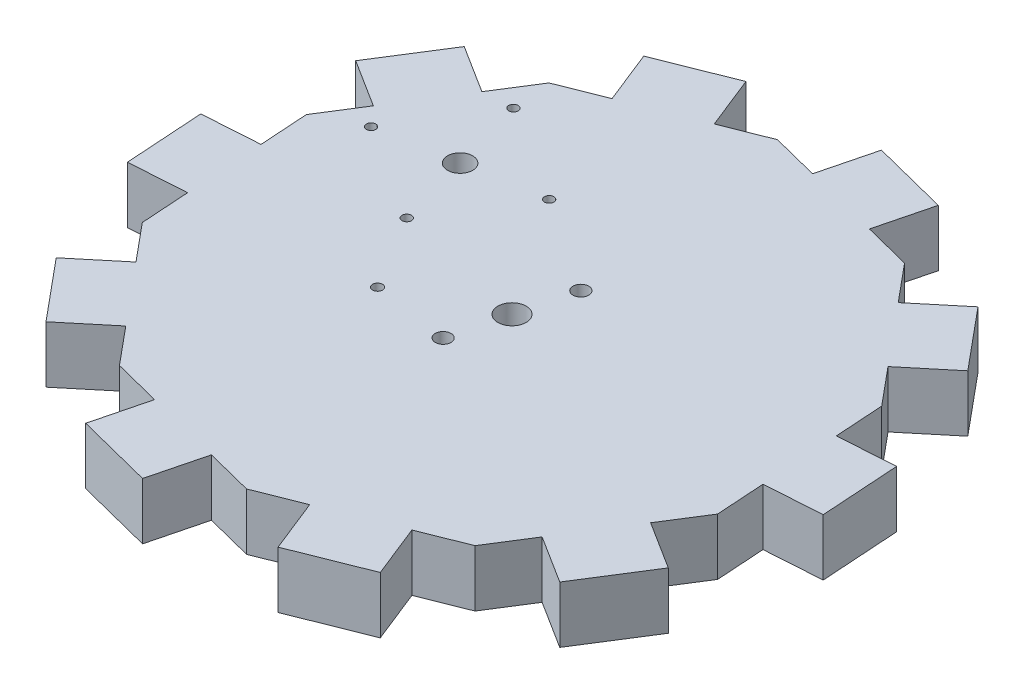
ISO-10303-21;
HEADER;
FILE_DESCRIPTION(('STEP AP214'),'2;1');
FILE_NAME('part.step','',(''),(''),'','','');
FILE_SCHEMA(('AUTOMOTIVE_DESIGN { 1 0 10303 214 1 1 1 1 }'));
ENDSEC;
DATA;
#1=APPLICATION_CONTEXT('core data for automotive mechanical design processes');
#2=APPLICATION_PROTOCOL_DEFINITION('international standard','automotive_design',2000,#1);
#3=PRODUCT_CONTEXT('',#1,'mechanical');
#4=PRODUCT('Part','Part','',(#3));
#5=PRODUCT_RELATED_PRODUCT_CATEGORY('part','',(#4));
#6=PRODUCT_DEFINITION_FORMATION('','',#4);
#7=PRODUCT_DEFINITION_CONTEXT('part definition',#1,'design');
#8=PRODUCT_DEFINITION('design','',#6,#7);
#9=PRODUCT_DEFINITION_SHAPE('','',#8);
#10=(LENGTH_UNIT() NAMED_UNIT(*) SI_UNIT(.MILLI.,.METRE.));
#11=(NAMED_UNIT(*) PLANE_ANGLE_UNIT() SI_UNIT($,.RADIAN.));
#12=(NAMED_UNIT(*) SI_UNIT($,.STERADIAN.) SOLID_ANGLE_UNIT());
#13=UNCERTAINTY_MEASURE_WITH_UNIT(LENGTH_MEASURE(1.E-05),#10,'distance_accuracy_value','');
#14=(GEOMETRIC_REPRESENTATION_CONTEXT(3) GLOBAL_UNCERTAINTY_ASSIGNED_CONTEXT((#13)) GLOBAL_UNIT_ASSIGNED_CONTEXT((#10,
#11,#12)) REPRESENTATION_CONTEXT('',''));
#15=CARTESIAN_POINT('',(0.,0.,0.));
#16=DIRECTION('',(0.,0.,1.));
#17=DIRECTION('',(1.,0.,0.));
#18=AXIS2_PLACEMENT_3D('',#15,#16,#17);
#19=CARTESIAN_POINT('',(-109.269570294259,18.,-9.49626430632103));
#20=DIRECTION('',(0.997876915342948,0.,-0.0651280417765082));
#21=DIRECTION('',(-0.0651280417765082,0.,-0.997876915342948));
#22=AXIS2_PLACEMENT_3D('',#19,#20,#21);
#23=PLANE('',#22);
#24=DIRECTION('',(0.0651280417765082,0.,0.997876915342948));
#25=VECTOR('',#24,1.);
#26=CARTESIAN_POINT('',(-109.269570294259,0.,-9.49626430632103));
#27=LINE('',#26,#25);
#28=CARTESIAN_POINT('',(-109.269570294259,0.,-9.49626430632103));
#29=VERTEX_POINT('',#28);
#30=CARTESIAN_POINT('',(-108.263791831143,0.,5.9140425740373));
#31=VERTEX_POINT('',#30);
#32=EDGE_CURVE('E791',#29,#31,#27,.T.);
#33=ORIENTED_EDGE('',*,*,#32,.T.);
#34=DIRECTION('',(0.,1.,0.));
#35=VECTOR('',#34,1.);
#36=CARTESIAN_POINT('',(-108.263791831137,-42.8233447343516,5.91404257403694));
#37=LINE('',#36,#35);
#38=CARTESIAN_POINT('',(-108.263791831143,18.,5.9140425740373));
#39=VERTEX_POINT('',#38);
#40=EDGE_CURVE('E57',#31,#39,#37,.T.);
#41=ORIENTED_EDGE('',*,*,#40,.T.);
#42=DIRECTION('',(0.0651280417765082,0.,0.997876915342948));
#43=VECTOR('',#42,1.);
#44=CARTESIAN_POINT('',(-109.269570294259,18.,-9.49626430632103));
#45=LINE('',#44,#43);
#46=CARTESIAN_POINT('',(-109.269570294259,18.,-9.49626430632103));
#47=VERTEX_POINT('',#46);
#48=EDGE_CURVE('E424',#47,#39,#45,.T.);
#49=ORIENTED_EDGE('',*,*,#48,.F.);
#50=DIRECTION('',(0.,-1.,0.));
#51=VECTOR('',#50,1.);
#52=CARTESIAN_POINT('',(-109.269570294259,18.,-9.49626430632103));
#53=LINE('',#52,#51);
#54=EDGE_CURVE('E837',#47,#29,#53,.T.);
#55=ORIENTED_EDGE('',*,*,#54,.T.);
#56=EDGE_LOOP('',(#33,#41,#49,#55));
#57=FACE_BOUND('',#56,.T.);
#58=ADVANCED_FACE('F33',(#57),#23,.F.);
#59=CARTESIAN_POINT('',(-105.629812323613,18.,46.2712723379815));
#60=DIRECTION('',(0.769018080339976,0.,-0.639227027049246));
#61=DIRECTION('',(-0.639227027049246,0.,-0.769018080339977));
#62=AXIS2_PLACEMENT_3D('',#59,#60,#61);
#63=PLANE('',#62);
#64=DIRECTION('',(0.639227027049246,0.,0.769018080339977));
#65=VECTOR('',#64,1.);
#66=CARTESIAN_POINT('',(-105.629812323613,0.,46.2712723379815));
#67=LINE('',#66,#65);
#68=CARTESIAN_POINT('',(-105.629812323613,0.,46.2712723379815));
#69=VERTEX_POINT('',#68);
#70=CARTESIAN_POINT('',(-95.7581693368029,0.,58.1472907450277));
#71=VERTEX_POINT('',#70);
#72=EDGE_CURVE('E794',#69,#71,#67,.T.);
#73=ORIENTED_EDGE('',*,*,#72,.T.);
#74=DIRECTION('',(0.,1.,0.));
#75=VECTOR('',#74,1.);
#76=CARTESIAN_POINT('',(-95.7581693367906,-42.8233447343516,58.1472907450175));
#77=LINE('',#76,#75);
#78=CARTESIAN_POINT('',(-95.7581693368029,18.,58.1472907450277));
#79=VERTEX_POINT('',#78);
#80=EDGE_CURVE('E441',#71,#79,#77,.T.);
#81=ORIENTED_EDGE('',*,*,#80,.T.);
#82=DIRECTION('',(0.639227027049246,0.,0.769018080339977));
#83=VECTOR('',#82,1.);
#84=CARTESIAN_POINT('',(-105.629812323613,18.,46.2712723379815));
#85=LINE('',#84,#83);
#86=CARTESIAN_POINT('',(-105.629812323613,18.,46.2712723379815));
#87=VERTEX_POINT('',#86);
#88=EDGE_CURVE('E758',#87,#79,#85,.T.);
#89=ORIENTED_EDGE('',*,*,#88,.F.);
#90=DIRECTION('',(0.,-1.,0.));
#91=VECTOR('',#90,1.);
#92=CARTESIAN_POINT('',(-105.629812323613,18.,46.2712723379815));
#93=LINE('',#92,#91);
#94=EDGE_CURVE('E834',#87,#69,#93,.T.);
#95=ORIENTED_EDGE('',*,*,#94,.T.);
#96=EDGE_LOOP('',(#73,#81,#89,#95));
#97=FACE_BOUND('',#96,.T.);
#98=ADVANCED_FACE('F927',(#97),#63,.F.);
#99=CARTESIAN_POINT('',(-69.905850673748,18.,89.2487611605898));
#100=DIRECTION('',(0.246420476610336,0.,-0.969163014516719));
#101=DIRECTION('',(-0.96916301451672,0.,-0.246420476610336));
#102=AXIS2_PLACEMENT_3D('',#99,#100,#101);
#103=PLANE('',#102);
#104=DIRECTION('',(0.969163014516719,0.,0.246420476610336));
#105=VECTOR('',#104,1.);
#106=CARTESIAN_POINT('',(-69.905850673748,0.,89.2487611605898));
#107=LINE('',#106,#105);
#108=CARTESIAN_POINT('',(-69.905850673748,0.,89.2487611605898));
#109=VERTEX_POINT('',#108);
#110=CARTESIAN_POINT('',(-54.9389752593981,0.,93.0542557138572));
#111=VERTEX_POINT('',#110);
#112=EDGE_CURVE('E797',#109,#111,#107,.T.);
#113=ORIENTED_EDGE('',*,*,#112,.T.);
#114=DIRECTION('',(0.,1.,0.));
#115=VECTOR('',#114,1.);
#116=CARTESIAN_POINT('',(-54.9389752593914,-42.8233447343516,93.054255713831));
#117=LINE('',#116,#115);
#118=CARTESIAN_POINT('',(-54.9389752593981,18.,93.0542557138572));
#119=VERTEX_POINT('',#118);
#120=EDGE_CURVE('E466',#111,#119,#117,.T.);
#121=ORIENTED_EDGE('',*,*,#120,.T.);
#122=DIRECTION('',(0.969163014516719,0.,0.246420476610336));
#123=VECTOR('',#122,1.);
#124=CARTESIAN_POINT('',(-69.905850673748,18.,89.2487611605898));
#125=LINE('',#124,#123);
#126=CARTESIAN_POINT('',(-69.905850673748,18.,89.2487611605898));
#127=VERTEX_POINT('',#126);
#128=EDGE_CURVE('E762',#127,#119,#125,.T.);
#129=ORIENTED_EDGE('',*,*,#128,.F.);
#130=DIRECTION('',(0.,-1.,0.));
#131=VECTOR('',#130,1.);
#132=CARTESIAN_POINT('',(-69.905850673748,18.,89.2487611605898));
#133=LINE('',#132,#131);
#134=EDGE_CURVE('E831',#127,#109,#133,.T.);
#135=ORIENTED_EDGE('',*,*,#134,.T.);
#136=EDGE_LOOP('',(#113,#121,#129,#135));
#137=FACE_BOUND('',#136,.T.);
#138=ADVANCED_FACE('F934',(#137),#103,.F.);
#139=CARTESIAN_POINT('',(-15.730168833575,18.,103.023530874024));
#140=DIRECTION('',(-0.370430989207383,0.,-0.928859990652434));
#141=DIRECTION('',(-0.928859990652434,0.,0.370430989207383));
#142=AXIS2_PLACEMENT_3D('',#139,#140,#141);
#143=PLANE('',#142);
#144=DIRECTION('',(0.928859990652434,0.,-0.370430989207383));
#145=VECTOR('',#144,1.);
#146=CARTESIAN_POINT('',(-15.730168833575,0.,103.023530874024));
#147=LINE('',#146,#145);
#148=CARTESIAN_POINT('',(-15.730168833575,0.,103.023530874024));
#149=VERTEX_POINT('',#148);
#150=CARTESIAN_POINT('',(-1.39566459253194,0.,97.3069055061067));
#151=VERTEX_POINT('',#150);
#152=EDGE_CURVE('E800',#149,#151,#147,.T.);
#153=ORIENTED_EDGE('',*,*,#152,.T.);
#154=DIRECTION('',(0.,1.,0.));
#155=VECTOR('',#154,1.);
#156=CARTESIAN_POINT('',(-1.39566459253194,18.,97.3069055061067));
#157=LINE('',#156,#155);
#158=CARTESIAN_POINT('',(-1.39566459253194,18.,97.3069055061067));
#159=VERTEX_POINT('',#158);
#160=EDGE_CURVE('E510',#151,#159,#157,.T.);
#161=ORIENTED_EDGE('',*,*,#160,.T.);
#162=DIRECTION('',(0.928859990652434,0.,-0.370430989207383));
#163=VECTOR('',#162,1.);
#164=CARTESIAN_POINT('',(-15.730168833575,18.,103.023530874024));
#165=LINE('',#164,#163);
#166=CARTESIAN_POINT('',(-15.730168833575,18.,103.023530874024));
#167=VERTEX_POINT('',#166);
#168=EDGE_CURVE('E766',#167,#159,#165,.T.);
#169=ORIENTED_EDGE('',*,*,#168,.F.);
#170=DIRECTION('',(0.,-1.,0.));
#171=VECTOR('',#170,1.);
#172=CARTESIAN_POINT('',(-15.730168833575,18.,103.023530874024));
#173=LINE('',#172,#171);
#174=EDGE_CURVE('E828',#167,#149,#173,.T.);
#175=ORIENTED_EDGE('',*,*,#174,.T.);
#176=EDGE_LOOP('',(#153,#161,#169,#175));
#177=FACE_BOUND('',#176,.T.);
#178=ADVANCED_FACE('F1111',(#177),#143,.F.);
#179=CARTESIAN_POINT('',(36.1703075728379,18.,82.32553008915));
#180=DIRECTION('',(-0.845580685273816,0.,-0.533847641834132));
#181=DIRECTION('',(-0.533847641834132,0.,0.845580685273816));
#182=AXIS2_PLACEMENT_3D('',#179,#180,#181);
#183=PLANE('',#182);
#184=DIRECTION('',(0.533847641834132,0.,-0.845580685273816));
#185=VECTOR('',#184,1.);
#186=CARTESIAN_POINT('',(36.1703075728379,0.,82.32553008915));
#187=LINE('',#186,#185);
#188=CARTESIAN_POINT('',(36.1703075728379,0.,82.32553008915));
#189=VERTEX_POINT('',#188);
#190=CARTESIAN_POINT('',(44.4145668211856,0.,69.2671481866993));
#191=VERTEX_POINT('',#190);
#192=EDGE_CURVE('E803',#189,#191,#187,.T.);
#193=ORIENTED_EDGE('',*,*,#192,.T.);
#194=DIRECTION('',(0.,1.,0.));
#195=VECTOR('',#194,1.);
#196=CARTESIAN_POINT('',(44.4145668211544,-42.8233447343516,69.2671481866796));
#197=LINE('',#196,#195);
#198=CARTESIAN_POINT('',(44.4145668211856,18.,69.2671481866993));
#199=VERTEX_POINT('',#198);
#200=EDGE_CURVE('E516',#191,#199,#197,.T.);
#201=ORIENTED_EDGE('',*,*,#200,.T.);
#202=DIRECTION('',(0.533847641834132,0.,-0.845580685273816));
#203=VECTOR('',#202,1.);
#204=CARTESIAN_POINT('',(36.1703075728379,18.,82.32553008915));
#205=LINE('',#204,#203);
#206=CARTESIAN_POINT('',(36.1703075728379,18.,82.32553008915));
#207=VERTEX_POINT('',#206);
#208=EDGE_CURVE('E769',#207,#199,#205,.T.);
#209=ORIENTED_EDGE('',*,*,#208,.F.);
#210=DIRECTION('',(0.,-1.,0.));
#211=VECTOR('',#210,1.);
#212=CARTESIAN_POINT('',(36.1703075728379,18.,82.32553008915));
#213=LINE('',#212,#211);
#214=EDGE_CURVE('E825',#207,#189,#213,.T.);
#215=ORIENTED_EDGE('',*,*,#214,.T.);
#216=EDGE_LOOP('',(#193,#201,#209,#215));
#217=FACE_BOUND('',#216,.T.);
#218=ADVANCED_FACE('F1088',(#217),#183,.F.);
#219=CARTESIAN_POINT('',(66.0050171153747,18.,35.069249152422));
#220=DIRECTION('',(-0.997876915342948,0.,0.0651280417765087));
#221=DIRECTION('',(0.0651280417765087,0.,0.997876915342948));
#222=AXIS2_PLACEMENT_3D('',#219,#220,#221);
#223=PLANE('',#222);
#224=DIRECTION('',(-0.0651280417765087,0.,-0.997876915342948));
#225=VECTOR('',#224,1.);
#226=CARTESIAN_POINT('',(66.0050171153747,0.,35.069249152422));
#227=LINE('',#226,#225);
#228=CARTESIAN_POINT('',(66.0050171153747,0.,35.069249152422));
#229=VERTEX_POINT('',#228);
#230=CARTESIAN_POINT('',(64.9992386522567,0.,19.6589422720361));
#231=VERTEX_POINT('',#230);
#232=EDGE_CURVE('E806',#229,#231,#227,.T.);
#233=ORIENTED_EDGE('',*,*,#232,.T.);
#234=DIRECTION('',(0.,1.,0.));
#235=VECTOR('',#234,1.);
#236=CARTESIAN_POINT('',(64.9992386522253,-42.8233447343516,19.6589422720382));
#237=LINE('',#236,#235);
#238=CARTESIAN_POINT('',(64.9992386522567,18.,19.6589422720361));
#239=VERTEX_POINT('',#238);
#240=EDGE_CURVE('E541',#231,#239,#237,.T.);
#241=ORIENTED_EDGE('',*,*,#240,.T.);
#242=DIRECTION('',(-0.0651280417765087,0.,-0.997876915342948));
#243=VECTOR('',#242,1.);
#244=CARTESIAN_POINT('',(66.0050171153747,18.,35.069249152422));
#245=LINE('',#244,#243);
#246=CARTESIAN_POINT('',(66.0050171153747,18.,35.069249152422));
#247=VERTEX_POINT('',#246);
#248=EDGE_CURVE('E773',#247,#239,#245,.T.);
#249=ORIENTED_EDGE('',*,*,#248,.F.);
#250=DIRECTION('',(0.,-1.,0.));
#251=VECTOR('',#250,1.);
#252=CARTESIAN_POINT('',(66.0050171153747,18.,35.069249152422));
#253=LINE('',#252,#251);
#254=EDGE_CURVE('E822',#247,#229,#253,.T.);
#255=ORIENTED_EDGE('',*,*,#254,.T.);
#256=EDGE_LOOP('',(#233,#241,#249,#255));
#257=FACE_BOUND('',#256,.T.);
#258=ADVANCED_FACE('F1065',(#257),#223,.F.);
#259=CARTESIAN_POINT('',(62.3652591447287,18.,-20.6982874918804));
#260=DIRECTION('',(-0.769018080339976,0.,0.639227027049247));
#261=DIRECTION('',(0.639227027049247,0.,0.769018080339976));
#262=AXIS2_PLACEMENT_3D('',#259,#260,#261);
#263=PLANE('',#262);
#264=DIRECTION('',(-0.639227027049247,0.,-0.769018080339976));
#265=VECTOR('',#264,1.);
#266=CARTESIAN_POINT('',(62.3652591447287,0.,-20.6982874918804));
#267=LINE('',#266,#265);
#268=CARTESIAN_POINT('',(62.3652591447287,0.,-20.6982874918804));
#269=VERTEX_POINT('',#268);
#270=CARTESIAN_POINT('',(52.4936161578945,0.,-32.5743058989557));
#271=VERTEX_POINT('',#270);
#272=EDGE_CURVE('E809',#269,#271,#267,.T.);
#273=ORIENTED_EDGE('',*,*,#272,.T.);
#274=DIRECTION('',(0.,1.,0.));
#275=VECTOR('',#274,1.);
#276=CARTESIAN_POINT('',(52.4936161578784,-42.8233447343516,-32.5743058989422));
#277=LINE('',#276,#275);
#278=CARTESIAN_POINT('',(52.4936161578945,18.,-32.5743058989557));
#279=VERTEX_POINT('',#278);
#280=EDGE_CURVE('E566',#271,#279,#277,.T.);
#281=ORIENTED_EDGE('',*,*,#280,.T.);
#282=DIRECTION('',(-0.639227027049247,0.,-0.769018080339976));
#283=VECTOR('',#282,1.);
#284=CARTESIAN_POINT('',(62.3652591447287,18.,-20.6982874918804));
#285=LINE('',#284,#283);
#286=CARTESIAN_POINT('',(62.3652591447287,18.,-20.6982874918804));
#287=VERTEX_POINT('',#286);
#288=EDGE_CURVE('E777',#287,#279,#285,.T.);
#289=ORIENTED_EDGE('',*,*,#288,.F.);
#290=DIRECTION('',(0.,-1.,0.));
#291=VECTOR('',#290,1.);
#292=CARTESIAN_POINT('',(62.3652591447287,18.,-20.6982874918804));
#293=LINE('',#292,#291);
#294=EDGE_CURVE('E819',#287,#269,#293,.T.);
#295=ORIENTED_EDGE('',*,*,#294,.T.);
#296=EDGE_LOOP('',(#273,#281,#289,#295));
#297=FACE_BOUND('',#296,.T.);
#298=ADVANCED_FACE('F1042',(#297),#263,.F.);
#299=CARTESIAN_POINT('',(-27.5215286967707,18.,-77.4472773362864));
#300=DIRECTION('',(-0.246285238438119,0.,0.969197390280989));
#301=DIRECTION('',(0.969197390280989,0.,0.246285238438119));
#302=AXIS2_PLACEMENT_3D('',#299,#300,#301);
#303=PLANE('',#302);
#304=DIRECTION('',(-0.969197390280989,0.,-0.246285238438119));
#305=VECTOR('',#304,1.);
#306=CARTESIAN_POINT('',(-27.5215286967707,0.,-77.4472773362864));
#307=LINE('',#306,#305);
#308=CARTESIAN_POINT('',(26.6328183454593,0.,-63.6859771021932));
#309=VERTEX_POINT('',#308);
#310=CARTESIAN_POINT('',(11.6758127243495,0.,-67.4867402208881));
#311=VERTEX_POINT('',#310);
#312=EDGE_CURVE('E812',#309,#311,#307,.T.);
#313=ORIENTED_EDGE('',*,*,#312,.T.);
#314=DIRECTION('',(0.,1.,0.));
#315=VECTOR('',#314,1.);
#316=CARTESIAN_POINT('',(11.6758127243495,18.,-67.4867402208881));
#317=LINE('',#316,#315);
#318=CARTESIAN_POINT('',(11.6758127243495,18.,-67.4867402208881));
#319=VERTEX_POINT('',#318);
#320=EDGE_CURVE('E610',#311,#319,#317,.T.);
#321=ORIENTED_EDGE('',*,*,#320,.T.);
#322=DIRECTION('',(-0.969197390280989,0.,-0.246285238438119));
#323=VECTOR('',#322,1.);
#324=CARTESIAN_POINT('',(-27.5215286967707,18.,-77.4472773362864));
#325=LINE('',#324,#323);
#326=CARTESIAN_POINT('',(26.6328183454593,18.,-63.6859771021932));
#327=VERTEX_POINT('',#326);
#328=EDGE_CURVE('E781',#327,#319,#325,.T.);
#329=ORIENTED_EDGE('',*,*,#328,.F.);
#330=DIRECTION('',(0.,-1.,0.));
#331=VECTOR('',#330,1.);
#332=CARTESIAN_POINT('',(26.6328183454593,18.,-63.6859771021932));
#333=LINE('',#332,#331);
#334=EDGE_CURVE('E816',#327,#309,#333,.T.);
#335=ORIENTED_EDGE('',*,*,#334,.T.);
#336=EDGE_LOOP('',(#313,#321,#329,#335));
#337=FACE_BOUND('',#336,.T.);
#338=ADVANCED_FACE('F965',(#337),#303,.F.);
#339=CARTESIAN_POINT('',(-27.5215286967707,18.,-77.4472773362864));
#340=DIRECTION('',(0.370301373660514,0.,0.928911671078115));
#341=DIRECTION('',(0.928911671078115,0.,-0.370301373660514));
#342=AXIS2_PLACEMENT_3D('',#339,#340,#341);
#343=PLANE('',#342);
#344=DIRECTION('',(-0.928911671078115,0.,0.370301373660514));
#345=VECTOR('',#344,1.);
#346=CARTESIAN_POINT('',(-27.5215286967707,0.,-77.4472773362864));
#347=LINE('',#346,#345);
#348=CARTESIAN_POINT('',(-27.5215286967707,0.,-77.4472773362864));
#349=VERTEX_POINT('',#348);
#350=CARTESIAN_POINT('',(-41.8667988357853,0.,-71.728678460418));
#351=VERTEX_POINT('',#350);
#352=EDGE_CURVE('E785',#349,#351,#347,.T.);
#353=ORIENTED_EDGE('',*,*,#352,.T.);
#354=DIRECTION('',(0.,1.,0.));
#355=VECTOR('',#354,1.);
#356=CARTESIAN_POINT('',(-41.8667988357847,-42.8233447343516,-71.7286784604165));
#357=LINE('',#356,#355);
#358=CARTESIAN_POINT('',(-41.8667988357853,18.,-71.728678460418));
#359=VERTEX_POINT('',#358);
#360=EDGE_CURVE('E616',#351,#359,#357,.T.);
#361=ORIENTED_EDGE('',*,*,#360,.T.);
#362=DIRECTION('',(-0.928911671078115,0.,0.370301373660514));
#363=VECTOR('',#362,1.);
#364=CARTESIAN_POINT('',(-27.5215286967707,18.,-77.4472773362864));
#365=LINE('',#364,#363);
#366=CARTESIAN_POINT('',(-27.5215286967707,18.,-77.4472773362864));
#367=VERTEX_POINT('',#366);
#368=EDGE_CURVE('E748',#367,#359,#365,.T.);
#369=ORIENTED_EDGE('',*,*,#368,.F.);
#370=DIRECTION('',(0.,-1.,0.));
#371=VECTOR('',#370,1.);
#372=CARTESIAN_POINT('',(-27.5215286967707,18.,-77.4472773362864));
#373=LINE('',#372,#371);
#374=EDGE_CURVE('E784',#367,#349,#373,.T.);
#375=ORIENTED_EDGE('',*,*,#374,.T.);
#376=EDGE_LOOP('',(#353,#361,#369,#375));
#377=FACE_BOUND('',#376,.T.);
#378=ADVANCED_FACE('F956',(#377),#343,.F.);
#379=CARTESIAN_POINT('',(-79.4348607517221,18.,-56.7525452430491));
#380=DIRECTION('',(0.845580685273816,0.,0.533847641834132));
#381=DIRECTION('',(0.533847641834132,0.,-0.845580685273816));
#382=AXIS2_PLACEMENT_3D('',#379,#380,#381);
#383=PLANE('',#382);
#384=DIRECTION('',(-0.533847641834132,0.,0.845580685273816));
#385=VECTOR('',#384,1.);
#386=CARTESIAN_POINT('',(-79.4348607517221,0.,-56.7525452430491));
#387=LINE('',#386,#385);
#388=CARTESIAN_POINT('',(-79.4348607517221,0.,-56.7525452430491));
#389=VERTEX_POINT('',#388);
#390=CARTESIAN_POINT('',(-87.6791200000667,0.,-43.6941633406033));
#391=VERTEX_POINT('',#390);
#392=EDGE_CURVE('E788',#389,#391,#387,.T.);
#393=ORIENTED_EDGE('',*,*,#392,.T.);
#394=DIRECTION('',(0.,1.,0.));
#395=VECTOR('',#394,1.);
#396=CARTESIAN_POINT('',(-87.6791200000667,-42.8233447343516,-43.6941633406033));
#397=LINE('',#396,#395);
#398=CARTESIAN_POINT('',(-87.6791200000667,18.,-43.6941633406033));
#399=VERTEX_POINT('',#398);
#400=EDGE_CURVE('E641',#391,#399,#397,.T.);
#401=ORIENTED_EDGE('',*,*,#400,.T.);
#402=DIRECTION('',(-0.533847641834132,0.,0.845580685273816));
#403=VECTOR('',#402,1.);
#404=CARTESIAN_POINT('',(-79.4348607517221,18.,-56.7525452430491));
#405=LINE('',#404,#403);
#406=CARTESIAN_POINT('',(-79.4348607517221,18.,-56.7525452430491));
#407=VERTEX_POINT('',#406);
#408=EDGE_CURVE('E753',#407,#399,#405,.T.);
#409=ORIENTED_EDGE('',*,*,#408,.F.);
#410=DIRECTION('',(0.,-1.,0.));
#411=VECTOR('',#410,1.);
#412=CARTESIAN_POINT('',(-79.4348607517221,18.,-56.7525452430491));
#413=LINE('',#412,#411);
#414=EDGE_CURVE('E840',#407,#389,#413,.T.);
#415=ORIENTED_EDGE('',*,*,#414,.T.);
#416=EDGE_LOOP('',(#393,#401,#409,#415));
#417=FACE_BOUND('',#416,.T.);
#418=ADVANCED_FACE('F949',(#417),#383,.F.);
#419=CARTESIAN_POINT('',(-50.4584516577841,18.,26.6807945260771));
#420=DIRECTION('',(0.,-1.,0.));
#421=DIRECTION('',(0.,0.,-1.));
#422=AXIS2_PLACEMENT_3D('',#419,#420,#421);
#423=CYLINDRICAL_SURFACE('',#422,1.6);
#424=CARTESIAN_POINT('',(-50.4584516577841,18.,26.6807945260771));
#425=DIRECTION('',(0.,-1.,0.));
#426=DIRECTION('',(0.,0.,-1.));
#427=AXIS2_PLACEMENT_3D('',#424,#425,#426);
#428=CIRCLE('',#427,1.6);
#429=CARTESIAN_POINT('',(-50.4584516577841,18.,25.0807945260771));
#430=VERTEX_POINT('',#429);
#431=EDGE_CURVE('E668',#430,#430,#428,.T.);
#432=ORIENTED_EDGE('',*,*,#431,.F.);
#433=EDGE_LOOP('',(#432));
#434=FACE_BOUND('',#433,.T.);
#435=CARTESIAN_POINT('',(-50.4584516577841,10.,26.6807945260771));
#436=DIRECTION('',(0.,-1.,0.));
#437=DIRECTION('',(0.,0.,-1.));
#438=AXIS2_PLACEMENT_3D('',#435,#436,#437);
#439=CIRCLE('',#438,1.6);
#440=CARTESIAN_POINT('',(-50.4584516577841,10.,25.0807945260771));
#441=VERTEX_POINT('',#440);
#442=EDGE_CURVE('E37',#441,#441,#439,.F.);
#443=ORIENTED_EDGE('',*,*,#442,.F.);
#444=EDGE_LOOP('',(#443));
#445=FACE_BOUND('',#444,.T.);
#446=ADVANCED_FACE('F953',(#434,#445),#423,.F.);
#447=CARTESIAN_POINT('',(-65.0895906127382,18.,-62.4711441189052));
#448=VERTEX_POINT('',#447);
#449=EDGE_CURVE('E752',#448,#407,#365,.T.);
#450=ORIENTED_EDGE('',*,*,#449,.F.);
#451=DIRECTION('',(0.,1.,0.));
#452=VECTOR('',#451,1.);
#453=CARTESIAN_POINT('',(-65.0895906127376,-42.8233447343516,-62.4711441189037));
#454=LINE('',#453,#452);
#455=CARTESIAN_POINT('',(-65.0895906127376,0.,-62.4711441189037));
#456=VERTEX_POINT('',#455);
#457=EDGE_CURVE('E630',#456,#448,#454,.T.);
#458=ORIENTED_EDGE('',*,*,#457,.F.);
#459=EDGE_CURVE('E745',#456,#389,#347,.T.);
#460=ORIENTED_EDGE('',*,*,#459,.T.);
#461=ORIENTED_EDGE('',*,*,#414,.F.);
#462=EDGE_LOOP('',(#450,#458,#460,#461));
#463=FACE_BOUND('',#462,.T.);
#464=ADVANCED_FACE('F947',(#463),#343,.F.);
#465=CARTESIAN_POINT('',(-101.02531104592,18.,-22.554646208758));
#466=VERTEX_POINT('',#465);
#467=EDGE_CURVE('E751',#466,#47,#405,.T.);
#468=ORIENTED_EDGE('',*,*,#467,.F.);
#469=DIRECTION('',(0.,1.,0.));
#470=VECTOR('',#469,1.);
#471=CARTESIAN_POINT('',(-101.02531104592,-42.8233447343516,-22.5546462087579));
#472=LINE('',#471,#470);
#473=CARTESIAN_POINT('',(-101.02531104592,0.,-22.5546462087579));
#474=VERTEX_POINT('',#473);
#475=EDGE_CURVE('E655',#474,#466,#472,.T.);
#476=ORIENTED_EDGE('',*,*,#475,.F.);
#477=EDGE_CURVE('E787',#474,#29,#387,.T.);
#478=ORIENTED_EDGE('',*,*,#477,.T.);
#479=ORIENTED_EDGE('',*,*,#54,.F.);
#480=EDGE_LOOP('',(#468,#476,#478,#479));
#481=FACE_BOUND('',#480,.T.);
#482=ADVANCED_FACE('F940',(#481),#383,.F.);
#483=CARTESIAN_POINT('',(-106.63559078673,18.,30.860965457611));
#484=VERTEX_POINT('',#483);
#485=EDGE_CURVE('E49',#484,#87,#45,.T.);
#486=ORIENTED_EDGE('',*,*,#485,.F.);
#487=DIRECTION('',(0.,1.,0.));
#488=VECTOR('',#487,1.);
#489=CARTESIAN_POINT('',(-106.635590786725,-42.8233447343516,30.8609654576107));
#490=LINE('',#489,#488);
#491=CARTESIAN_POINT('',(-106.635590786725,0.,30.8609654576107));
#492=VERTEX_POINT('',#491);
#493=EDGE_CURVE('E432',#492,#484,#490,.T.);
#494=ORIENTED_EDGE('',*,*,#493,.F.);
#495=EDGE_CURVE('E790',#492,#69,#27,.T.);
#496=ORIENTED_EDGE('',*,*,#495,.T.);
#497=ORIENTED_EDGE('',*,*,#94,.F.);
#498=EDGE_LOOP('',(#486,#494,#496,#497));
#499=FACE_BOUND('',#498,.T.);
#500=ADVANCED_FACE('F929',(#499),#23,.F.);
#501=CARTESIAN_POINT('',(-79.7774936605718,18.,77.3727427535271));
#502=VERTEX_POINT('',#501);
#503=EDGE_CURVE('E757',#502,#127,#85,.T.);
#504=ORIENTED_EDGE('',*,*,#503,.F.);
#505=DIRECTION('',(0.,1.,0.));
#506=VECTOR('',#505,1.);
#507=CARTESIAN_POINT('',(-79.7774936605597,-42.8233447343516,77.3727427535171));
#508=LINE('',#507,#506);
#509=CARTESIAN_POINT('',(-79.7774936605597,0.,77.3727427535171));
#510=VERTEX_POINT('',#509);
#511=EDGE_CURVE('E455',#510,#502,#508,.T.);
#512=ORIENTED_EDGE('',*,*,#511,.F.);
#513=EDGE_CURVE('E793',#510,#109,#67,.T.);
#514=ORIENTED_EDGE('',*,*,#513,.T.);
#515=ORIENTED_EDGE('',*,*,#134,.F.);
#516=EDGE_LOOP('',(#504,#512,#514,#515));
#517=FACE_BOUND('',#516,.T.);
#518=ADVANCED_FACE('F937',(#517),#63,.F.);
#519=CARTESIAN_POINT('',(-30.7098998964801,18.,99.2147676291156));
#520=VERTEX_POINT('',#519);
#521=EDGE_CURVE('E761',#520,#167,#125,.T.);
#522=ORIENTED_EDGE('',*,*,#521,.F.);
#523=DIRECTION('',(0.,1.,0.));
#524=VECTOR('',#523,1.);
#525=CARTESIAN_POINT('',(-30.7098998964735,-42.8233447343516,99.2147676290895));
#526=LINE('',#525,#524);
#527=CARTESIAN_POINT('',(-30.7098998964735,0.,99.2147676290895));
#528=VERTEX_POINT('',#527);
#529=EDGE_CURVE('E480',#528,#520,#526,.T.);
#530=ORIENTED_EDGE('',*,*,#529,.F.);
#531=EDGE_CURVE('E796',#528,#149,#107,.T.);
#532=ORIENTED_EDGE('',*,*,#531,.T.);
#533=ORIENTED_EDGE('',*,*,#174,.F.);
#534=EDGE_LOOP('',(#522,#530,#532,#533));
#535=FACE_BOUND('',#534,.T.);
#536=ADVANCED_FACE('F945',(#535),#103,.F.);
#537=CARTESIAN_POINT('',(21.8258353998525,18.,88.0461306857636));
#538=VERTEX_POINT('',#537);
#539=EDGE_CURVE('E765',#538,#207,#165,.T.);
#540=ORIENTED_EDGE('',*,*,#539,.F.);
#541=DIRECTION('',(0.,-1.,0.));
#542=VECTOR('',#541,1.);
#543=CARTESIAN_POINT('',(21.8258353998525,18.,88.0461306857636));
#544=LINE('',#543,#542);
#545=CARTESIAN_POINT('',(21.8258353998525,0.,88.0461306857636));
#546=VERTEX_POINT('',#545);
#547=EDGE_CURVE('E507',#538,#546,#544,.T.);
#548=ORIENTED_EDGE('',*,*,#547,.T.);
#549=EDGE_CURVE('E799',#546,#189,#147,.T.);
#550=ORIENTED_EDGE('',*,*,#549,.T.);
#551=ORIENTED_EDGE('',*,*,#214,.F.);
#552=EDGE_LOOP('',(#540,#548,#550,#551));
#553=FACE_BOUND('',#552,.T.);
#554=ADVANCED_FACE('F1093',(#553),#143,.F.);
#555=CARTESIAN_POINT('',(57.7607578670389,18.,48.1276310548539));
#556=VERTEX_POINT('',#555);
#557=EDGE_CURVE('E768',#556,#247,#205,.T.);
#558=ORIENTED_EDGE('',*,*,#557,.F.);
#559=DIRECTION('',(0.,1.,0.));
#560=VECTOR('',#559,1.);
#561=CARTESIAN_POINT('',(57.7607578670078,-42.8233447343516,48.1276310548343));
#562=LINE('',#561,#560);
#563=CARTESIAN_POINT('',(57.7607578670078,0.,48.1276310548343));
#564=VERTEX_POINT('',#563);
#565=EDGE_CURVE('E530',#564,#556,#562,.T.);
#566=ORIENTED_EDGE('',*,*,#565,.F.);
#567=EDGE_CURVE('E802',#564,#229,#187,.T.);
#568=ORIENTED_EDGE('',*,*,#567,.T.);
#569=ORIENTED_EDGE('',*,*,#254,.F.);
#570=EDGE_LOOP('',(#558,#566,#568,#569));
#571=FACE_BOUND('',#570,.T.);
#572=ADVANCED_FACE('F1070',(#571),#183,.F.);
#573=CARTESIAN_POINT('',(63.371037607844,18.,-5.28798061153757));
#574=VERTEX_POINT('',#573);
#575=EDGE_CURVE('E772',#574,#287,#245,.T.);
#576=ORIENTED_EDGE('',*,*,#575,.F.);
#577=DIRECTION('',(0.,1.,0.));
#578=VECTOR('',#577,1.);
#579=CARTESIAN_POINT('',(63.3710376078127,-42.8233447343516,-5.28798061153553));
#580=LINE('',#579,#578);
#581=CARTESIAN_POINT('',(63.3710376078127,0.,-5.28798061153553));
#582=VERTEX_POINT('',#581);
#583=EDGE_CURVE('E555',#582,#574,#580,.T.);
#584=ORIENTED_EDGE('',*,*,#583,.F.);
#585=EDGE_CURVE('E805',#582,#269,#227,.T.);
#586=ORIENTED_EDGE('',*,*,#585,.T.);
#587=ORIENTED_EDGE('',*,*,#294,.F.);
#588=EDGE_LOOP('',(#576,#584,#586,#587));
#589=FACE_BOUND('',#588,.T.);
#590=ADVANCED_FACE('F1047',(#589),#223,.F.);
#591=CARTESIAN_POINT('',(36.5129404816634,18.,-51.7997579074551));
#592=VERTEX_POINT('',#591);
#593=EDGE_CURVE('E776',#592,#327,#285,.T.);
#594=ORIENTED_EDGE('',*,*,#593,.F.);
#595=DIRECTION('',(0.,1.,0.));
#596=VECTOR('',#595,1.);
#597=CARTESIAN_POINT('',(36.5129404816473,-42.8233447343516,-51.7997579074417));
#598=LINE('',#597,#596);
#599=CARTESIAN_POINT('',(36.5129404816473,0.,-51.7997579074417));
#600=VERTEX_POINT('',#599);
#601=EDGE_CURVE('E580',#600,#592,#598,.T.);
#602=ORIENTED_EDGE('',*,*,#601,.F.);
#603=EDGE_CURVE('E808',#600,#309,#267,.T.);
#604=ORIENTED_EDGE('',*,*,#603,.T.);
#605=ORIENTED_EDGE('',*,*,#334,.F.);
#606=EDGE_LOOP('',(#594,#602,#604,#605));
#607=FACE_BOUND('',#606,.T.);
#608=ADVANCED_FACE('F1025',(#607),#263,.F.);
#609=CARTESIAN_POINT('',(-12.5541222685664,18.,-73.643871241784));
#610=VERTEX_POINT('',#609);
#611=EDGE_CURVE('E780',#610,#367,#325,.T.);
#612=ORIENTED_EDGE('',*,*,#611,.F.);
#613=DIRECTION('',(0.,-1.,0.));
#614=VECTOR('',#613,1.);
#615=CARTESIAN_POINT('',(-12.5541222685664,18.,-73.643871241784));
#616=LINE('',#615,#614);
#617=CARTESIAN_POINT('',(-12.5541222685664,0.,-73.643871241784));
#618=VERTEX_POINT('',#617);
#619=EDGE_CURVE('E607',#610,#618,#616,.T.);
#620=ORIENTED_EDGE('',*,*,#619,.T.);
#621=EDGE_CURVE('E811',#618,#349,#307,.T.);
#622=ORIENTED_EDGE('',*,*,#621,.T.);
#623=ORIENTED_EDGE('',*,*,#374,.F.);
#624=EDGE_LOOP('',(#612,#620,#622,#623));
#625=FACE_BOUND('',#624,.T.);
#626=ADVANCED_FACE('F1000',(#625),#303,.F.);
#627=CARTESIAN_POINT('',(0.,18.,0.));
#628=DIRECTION('',(0.,1.,0.));
#629=DIRECTION('',(0.,0.,1.));
#630=AXIS2_PLACEMENT_3D('',#627,#628,#629);
#631=PLANE('',#630);
#632=ORIENTED_EDGE('',*,*,#168,.T.);
#633=DIRECTION('',(0.370301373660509,0.,0.928911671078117));
#634=VECTOR('',#633,1.);
#635=CARTESIAN_POINT('',(-1.39775434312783,18.,97.3016633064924));
#636=LINE('',#635,#634);
#637=CARTESIAN_POINT('',(5.26767038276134,18.,114.022073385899));
#638=VERTEX_POINT('',#637);
#639=EDGE_CURVE('E487',#159,#638,#636,.T.);
#640=ORIENTED_EDGE('',*,*,#639,.T.);
#641=DIRECTION('',(0.928911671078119,0.,-0.370301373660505));
#642=VECTOR('',#641,1.);
#643=CARTESIAN_POINT('',(5.26767038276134,18.,114.022073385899));
#644=LINE('',#643,#642);
#645=CARTESIAN_POINT('',(28.4904621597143,18.,104.764539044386));
#646=VERTEX_POINT('',#645);
#647=EDGE_CURVE('E496',#638,#646,#644,.T.);
#648=ORIENTED_EDGE('',*,*,#647,.T.);
#649=DIRECTION('',(-0.370301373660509,0.,-0.928911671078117));
#650=VECTOR('',#649,1.);
#651=CARTESIAN_POINT('',(21.8250374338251,18.,88.0441289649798));
#652=LINE('',#651,#650);
#653=EDGE_CURVE('E499',#646,#538,#652,.T.);
#654=ORIENTED_EDGE('',*,*,#653,.T.);
#655=ORIENTED_EDGE('',*,*,#539,.T.);
#656=ORIENTED_EDGE('',*,*,#208,.T.);
#657=DIRECTION('',(0.845580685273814,0.,0.533847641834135));
#658=VECTOR('',#657,1.);
#659=CARTESIAN_POINT('',(44.4145668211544,18.,69.2671481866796));
#660=LINE('',#659,#658);
#661=CARTESIAN_POINT('',(59.635019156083,18.,78.876405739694));
#662=VERTEX_POINT('',#661);
#663=EDGE_CURVE('E512',#199,#662,#660,.T.);
#664=ORIENTED_EDGE('',*,*,#663,.T.);
#665=DIRECTION('',(0.533847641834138,0.,-0.845580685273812));
#666=VECTOR('',#665,1.);
#667=CARTESIAN_POINT('',(59.635019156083,18.,78.876405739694));
#668=LINE('',#667,#666);
#669=CARTESIAN_POINT('',(72.9812102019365,18.,57.7368886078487));
#670=VERTEX_POINT('',#669);
#671=EDGE_CURVE('E522',#662,#670,#668,.T.);
#672=ORIENTED_EDGE('',*,*,#671,.T.);
#673=DIRECTION('',(-0.845580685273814,0.,-0.533847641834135));
#674=VECTOR('',#673,1.);
#675=CARTESIAN_POINT('',(57.7607578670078,18.,48.1276310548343));
#676=LINE('',#675,#674);
#677=EDGE_CURVE('E525',#670,#556,#676,.T.);
#678=ORIENTED_EDGE('',*,*,#677,.T.);
#679=ORIENTED_EDGE('',*,*,#557,.T.);
#680=ORIENTED_EDGE('',*,*,#248,.T.);
#681=DIRECTION('',(0.997876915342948,0.,-0.065128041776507));
#682=VECTOR('',#681,1.);
#683=CARTESIAN_POINT('',(64.9992386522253,18.,19.6589422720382));
#684=LINE('',#683,#682);
#685=CARTESIAN_POINT('',(82.9610231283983,18.,18.4866375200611));
#686=VERTEX_POINT('',#685);
#687=EDGE_CURVE('E537',#239,#686,#684,.T.);
#688=ORIENTED_EDGE('',*,*,#687,.T.);
#689=DIRECTION('',(-0.0651280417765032,0.,-0.997876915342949));
#690=VECTOR('',#689,1.);
#691=CARTESIAN_POINT('',(82.9610231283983,18.,18.4866375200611));
#692=LINE('',#691,#690);
#693=CARTESIAN_POINT('',(81.3328220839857,18.,-6.46028536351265));
#694=VERTEX_POINT('',#693);
#695=EDGE_CURVE('E547',#686,#694,#692,.T.);
#696=ORIENTED_EDGE('',*,*,#695,.T.);
#697=DIRECTION('',(-0.997876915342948,0.,0.065128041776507));
#698=VECTOR('',#697,1.);
#699=CARTESIAN_POINT('',(63.3710376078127,18.,-5.28798061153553));
#700=LINE('',#699,#698);
#701=EDGE_CURVE('E550',#694,#574,#700,.T.);
#702=ORIENTED_EDGE('',*,*,#701,.T.);
#703=ORIENTED_EDGE('',*,*,#575,.T.);
#704=ORIENTED_EDGE('',*,*,#288,.T.);
#705=DIRECTION('',(0.769018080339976,0.,-0.639227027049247));
#706=VECTOR('',#705,1.);
#707=CARTESIAN_POINT('',(52.4936161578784,18.,-32.5743058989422));
#708=LINE('',#707,#706);
#709=CARTESIAN_POINT('',(66.335941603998,18.,-44.0803923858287));
#710=VERTEX_POINT('',#709);
#711=EDGE_CURVE('E562',#279,#710,#708,.T.);
#712=ORIENTED_EDGE('',*,*,#711,.T.);
#713=DIRECTION('',(-0.639227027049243,0.,-0.769018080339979));
#714=VECTOR('',#713,1.);
#715=CARTESIAN_POINT('',(66.335941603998,18.,-44.0803923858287));
#716=LINE('',#715,#714);
#717=CARTESIAN_POINT('',(50.3552659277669,18.,-63.3058443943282));
#718=VERTEX_POINT('',#717);
#719=EDGE_CURVE('E572',#710,#718,#716,.T.);
#720=ORIENTED_EDGE('',*,*,#719,.T.);
#721=DIRECTION('',(-0.769018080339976,0.,0.639227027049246));
#722=VECTOR('',#721,1.);
#723=CARTESIAN_POINT('',(36.5129404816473,18.,-51.7997579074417));
#724=LINE('',#723,#722);
#725=EDGE_CURVE('E575',#718,#592,#724,.T.);
#726=ORIENTED_EDGE('',*,*,#725,.T.);
#727=ORIENTED_EDGE('',*,*,#593,.T.);
#728=ORIENTED_EDGE('',*,*,#328,.T.);
#729=DIRECTION('',(0.246420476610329,0.,-0.969163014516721));
#730=VECTOR('',#729,1.);
#731=CARTESIAN_POINT('',(11.674422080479,18.,-67.4812708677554));
#732=LINE('',#731,#730);
#733=CARTESIAN_POINT('',(16.1099906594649,18.,-84.9262051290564));
#734=VERTEX_POINT('',#733);
#735=EDGE_CURVE('E587',#319,#734,#732,.T.);
#736=ORIENTED_EDGE('',*,*,#735,.T.);
#737=DIRECTION('',(-0.96916301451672,0.,-0.246420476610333));
#738=VECTOR('',#737,1.);
#739=CARTESIAN_POINT('',(16.1099906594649,18.,-84.9262051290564));
#740=LINE('',#739,#738);
#741=CARTESIAN_POINT('',(-8.1190847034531,18.,-91.0867170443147));
#742=VERTEX_POINT('',#741);
#743=EDGE_CURVE('E596',#734,#742,#740,.T.);
#744=ORIENTED_EDGE('',*,*,#743,.T.);
#745=DIRECTION('',(-0.246420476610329,0.,0.969163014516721));
#746=VECTOR('',#745,1.);
#747=CARTESIAN_POINT('',(-12.554653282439,18.,-73.6417827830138));
#748=LINE('',#747,#746);
#749=EDGE_CURVE('E599',#742,#610,#748,.T.);
#750=ORIENTED_EDGE('',*,*,#749,.T.);
#751=ORIENTED_EDGE('',*,*,#611,.T.);
#752=ORIENTED_EDGE('',*,*,#368,.T.);
#753=DIRECTION('',(-0.370301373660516,0.,-0.928911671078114));
#754=VECTOR('',#753,1.);
#755=CARTESIAN_POINT('',(-41.8667988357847,18.,-71.7286784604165));
#756=LINE('',#755,#754);
#757=CARTESIAN_POINT('',(-48.532223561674,18.,-88.4490885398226));
#758=VERTEX_POINT('',#757);
#759=EDGE_CURVE('E612',#359,#758,#756,.T.);
#760=ORIENTED_EDGE('',*,*,#759,.T.);
#761=DIRECTION('',(-0.928911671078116,0.,0.370301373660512));
#762=VECTOR('',#761,1.);
#763=CARTESIAN_POINT('',(-48.532223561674,18.,-88.4490885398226));
#764=LINE('',#763,#762);
#765=CARTESIAN_POINT('',(-71.7550153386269,18.,-79.1915541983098));
#766=VERTEX_POINT('',#765);
#767=EDGE_CURVE('E622',#758,#766,#764,.T.);
#768=ORIENTED_EDGE('',*,*,#767,.T.);
#769=DIRECTION('',(0.370301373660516,0.,0.928911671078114));
#770=VECTOR('',#769,1.);
#771=CARTESIAN_POINT('',(-65.0895906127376,18.,-62.4711441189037));
#772=LINE('',#771,#770);
#773=EDGE_CURVE('E625',#766,#448,#772,.T.);
#774=ORIENTED_EDGE('',*,*,#773,.T.);
#775=ORIENTED_EDGE('',*,*,#449,.T.);
#776=ORIENTED_EDGE('',*,*,#408,.T.);
#777=DIRECTION('',(-0.845580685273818,0.,-0.533847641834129));
#778=VECTOR('',#777,1.);
#779=CARTESIAN_POINT('',(-87.6791200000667,18.,-43.6941633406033));
#780=LINE('',#779,#778);
#781=CARTESIAN_POINT('',(-102.899572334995,18.,-53.3034208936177));
#782=VERTEX_POINT('',#781);
#783=EDGE_CURVE('E637',#399,#782,#780,.T.);
#784=ORIENTED_EDGE('',*,*,#783,.T.);
#785=DIRECTION('',(-0.533847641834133,0.,0.845580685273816));
#786=VECTOR('',#785,1.);
#787=CARTESIAN_POINT('',(-102.899572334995,18.,-53.3034208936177));
#788=LINE('',#787,#786);
#789=CARTESIAN_POINT('',(-116.245763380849,18.,-32.1639037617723));
#790=VERTEX_POINT('',#789);
#791=EDGE_CURVE('E647',#782,#790,#788,.T.);
#792=ORIENTED_EDGE('',*,*,#791,.T.);
#793=DIRECTION('',(0.845580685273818,0.,0.533847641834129));
#794=VECTOR('',#793,1.);
#795=CARTESIAN_POINT('',(-101.02531104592,18.,-22.5546462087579));
#796=LINE('',#795,#794);
#797=EDGE_CURVE('E650',#790,#466,#796,.T.);
#798=ORIENTED_EDGE('',*,*,#797,.T.);
#799=ORIENTED_EDGE('',*,*,#467,.T.);
#800=ORIENTED_EDGE('',*,*,#48,.T.);
#801=DIRECTION('',(-0.997876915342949,0.,0.0651280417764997));
#802=VECTOR('',#801,1.);
#803=CARTESIAN_POINT('',(-108.263791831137,18.,5.91404257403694));
#804=LINE('',#803,#802);
#805=CARTESIAN_POINT('',(-126.22557630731,18.,7.08634732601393));
#806=VERTEX_POINT('',#805);
#807=EDGE_CURVE('E405',#39,#806,#804,.T.);
#808=ORIENTED_EDGE('',*,*,#807,.T.);
#809=DIRECTION('',(0.0651280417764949,0.,0.997876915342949));
#810=VECTOR('',#809,1.);
#811=CARTESIAN_POINT('',(-126.22557630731,18.,7.08634732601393));
#812=LINE('',#811,#810);
#813=CARTESIAN_POINT('',(-124.597375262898,18.,32.0332702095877));
#814=VERTEX_POINT('',#813);
#815=EDGE_CURVE('E414',#806,#814,#812,.T.);
#816=ORIENTED_EDGE('',*,*,#815,.T.);
#817=DIRECTION('',(0.997876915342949,0.,-0.0651280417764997));
#818=VECTOR('',#817,1.);
#819=CARTESIAN_POINT('',(-106.635590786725,18.,30.8609654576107));
#820=LINE('',#819,#818);
#821=EDGE_CURVE('E411',#814,#484,#820,.T.);
#822=ORIENTED_EDGE('',*,*,#821,.T.);
#823=ORIENTED_EDGE('',*,*,#485,.T.);
#824=ORIENTED_EDGE('',*,*,#88,.T.);
#825=DIRECTION('',(-0.769018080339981,0.,0.639227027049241));
#826=VECTOR('',#825,1.);
#827=CARTESIAN_POINT('',(-95.7581693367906,18.,58.1472907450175));
#828=LINE('',#827,#826);
#829=CARTESIAN_POINT('',(-109.60049478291,18.,69.6533772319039));
#830=VERTEX_POINT('',#829);
#831=EDGE_CURVE('E437',#79,#830,#828,.T.);
#832=ORIENTED_EDGE('',*,*,#831,.T.);
#833=DIRECTION('',(0.639227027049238,0.,0.769018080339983));
#834=VECTOR('',#833,1.);
#835=CARTESIAN_POINT('',(-109.60049478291,18.,69.6533772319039));
#836=LINE('',#835,#834);
#837=CARTESIAN_POINT('',(-93.6198191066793,18.,88.8788292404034));
#838=VERTEX_POINT('',#837);
#839=EDGE_CURVE('E447',#830,#838,#836,.T.);
#840=ORIENTED_EDGE('',*,*,#839,.T.);
#841=DIRECTION('',(0.769018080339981,0.,-0.639227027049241));
#842=VECTOR('',#841,1.);
#843=CARTESIAN_POINT('',(-79.7774936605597,18.,77.3727427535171));
#844=LINE('',#843,#842);
#845=EDGE_CURVE('E450',#838,#502,#844,.T.);
#846=ORIENTED_EDGE('',*,*,#845,.T.);
#847=ORIENTED_EDGE('',*,*,#503,.T.);
#848=ORIENTED_EDGE('',*,*,#128,.T.);
#849=DIRECTION('',(-0.246420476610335,0.,0.96916301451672));
#850=VECTOR('',#849,1.);
#851=CARTESIAN_POINT('',(-54.9389752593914,18.,93.054255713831));
#852=LINE('',#851,#850);
#853=CARTESIAN_POINT('',(-59.3745438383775,18.,110.499189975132));
#854=VERTEX_POINT('',#853);
#855=EDGE_CURVE('E462',#119,#854,#852,.T.);
#856=ORIENTED_EDGE('',*,*,#855,.T.);
#857=DIRECTION('',(0.969163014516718,0.,0.246420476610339));
#858=VECTOR('',#857,1.);
#859=CARTESIAN_POINT('',(-59.3745438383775,18.,110.499189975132));
#860=LINE('',#859,#858);
#861=CARTESIAN_POINT('',(-35.1454684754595,18.,116.65970189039));
#862=VERTEX_POINT('',#861);
#863=EDGE_CURVE('E472',#854,#862,#860,.T.);
#864=ORIENTED_EDGE('',*,*,#863,.T.);
#865=DIRECTION('',(0.246420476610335,0.,-0.96916301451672));
#866=VECTOR('',#865,1.);
#867=CARTESIAN_POINT('',(-30.7098998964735,18.,99.2147676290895));
#868=LINE('',#867,#866);
#869=EDGE_CURVE('E475',#862,#520,#868,.T.);
#870=ORIENTED_EDGE('',*,*,#869,.T.);
#871=ORIENTED_EDGE('',*,*,#521,.T.);
#872=EDGE_LOOP('',(#632,#640,#648,#654,#655,#656,#664,#672,#678,#679,#680,#688,#696,#702,#703,
#704,#712,#720,#726,#727,#728,#736,#744,#750,#751,#752,#760,#768,#774,#775,#776,#784,#792,#798,
#799,#800,#808,#816,#822,#823,#824,#832,#840,#846,#847,#848,#856,#864,#870,#871));
#873=FACE_BOUND('',#872,.T.);
#874=ORIENTED_EDGE('',*,*,#431,.T.);
#875=EDGE_LOOP('',(#874));
#876=FACE_BOUND('',#875,.T.);
#877=CARTESIAN_POINT('',(-78.1289983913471,18.,-44.1700343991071));
#878=DIRECTION('',(0.,-1.,0.));
#879=DIRECTION('',(0.,0.,1.));
#880=AXIS2_PLACEMENT_3D('',#877,#878,#879);
#881=CIRCLE('',#880,1.50000000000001);
#882=CARTESIAN_POINT('',(-78.1289983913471,18.,-42.6700343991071));
#883=VERTEX_POINT('',#882);
#884=EDGE_CURVE('E672',#883,#883,#881,.T.);
#885=ORIENTED_EDGE('',*,*,#884,.T.);
#886=EDGE_LOOP('',(#885));
#887=FACE_BOUND('',#886,.T.);
#888=CARTESIAN_POINT('',(-95.6392010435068,18.,-16.434987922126));
#889=DIRECTION('',(0.,-1.,0.));
#890=DIRECTION('',(0.,0.,-1.));
#891=AXIS2_PLACEMENT_3D('',#888,#889,#890);
#892=CIRCLE('',#891,1.50000000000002);
#893=CARTESIAN_POINT('',(-95.6392010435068,18.,-17.934987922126));
#894=VERTEX_POINT('',#893);
#895=EDGE_CURVE('E679',#894,#894,#892,.T.);
#896=ORIENTED_EDGE('',*,*,#895,.T.);
#897=EDGE_LOOP('',(#896));
#898=FACE_BOUND('',#897,.T.);
#899=CARTESIAN_POINT('',(-64.86006409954,18.,2.99706624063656));
#900=DIRECTION('',(0.,-1.,0.));
#901=DIRECTION('',(0.,0.,1.));
#902=AXIS2_PLACEMENT_3D('',#899,#900,#901);
#903=CIRCLE('',#902,1.5);
#904=CARTESIAN_POINT('',(-64.86006409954,18.,4.49706624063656));
#905=VERTEX_POINT('',#904);
#906=EDGE_CURVE('E685',#905,#905,#903,.T.);
#907=ORIENTED_EDGE('',*,*,#906,.T.);
#908=EDGE_LOOP('',(#907));
#909=FACE_BOUND('',#908,.T.);
#910=CARTESIAN_POINT('',(-47.3498614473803,18.,-24.7379802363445));
#911=DIRECTION('',(0.,-1.,0.));
#912=DIRECTION('',(0.,0.,-1.));
#913=AXIS2_PLACEMENT_3D('',#910,#911,#912);
#914=CIRCLE('',#913,1.5);
#915=CARTESIAN_POINT('',(-47.3498614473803,18.,-26.2379802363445));
#916=VERTEX_POINT('',#915);
#917=EDGE_CURVE('E690',#916,#916,#914,.T.);
#918=ORIENTED_EDGE('',*,*,#917,.T.);
#919=EDGE_LOOP('',(#918));
#920=FACE_BOUND('',#919,.T.);
#921=CARTESIAN_POINT('',(-71.4945312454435,18.,-20.5864840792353));
#922=DIRECTION('',(0.,-1.,0.));
#923=DIRECTION('',(0.,0.,-1.));
#924=AXIS2_PLACEMENT_3D('',#921,#922,#923);
#925=CIRCLE('',#924,4.00000000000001);
#926=CARTESIAN_POINT('',(-71.4945312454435,18.,-24.5864840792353));
#927=VERTEX_POINT('',#926);
#928=EDGE_CURVE('E696',#927,#927,#925,.T.);
#929=ORIENTED_EDGE('',*,*,#928,.T.);
#930=EDGE_LOOP('',(#929));
#931=FACE_BOUND('',#930,.T.);
#932=CARTESIAN_POINT('',(-21.6322765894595,18.,12.7864924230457));
#933=DIRECTION('',(0.,1.,0.));
#934=DIRECTION('',(0.,0.,1.));
#935=AXIS2_PLACEMENT_3D('',#932,#933,#934);
#936=CIRCLE('',#935,4.5);
#937=CARTESIAN_POINT('',(-21.6322765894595,18.,17.2864924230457));
#938=VERTEX_POINT('',#937);
#939=EDGE_CURVE('E734',#938,#938,#936,.T.);
#940=ORIENTED_EDGE('',*,*,#939,.F.);
#941=EDGE_LOOP('',(#940));
#942=FACE_BOUND('',#941,.T.);
#943=CARTESIAN_POINT('',(-26.0678451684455,18.,30.2314266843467));
#944=DIRECTION('',(0.,1.,0.));
#945=DIRECTION('',(0.,0.,1.));
#946=AXIS2_PLACEMENT_3D('',#943,#944,#945);
#947=CIRCLE('',#946,2.5);
#948=CARTESIAN_POINT('',(-26.0678451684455,18.,32.7314266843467));
#949=VERTEX_POINT('',#948);
#950=EDGE_CURVE('E729',#949,#949,#947,.T.);
#951=ORIENTED_EDGE('',*,*,#950,.F.);
#952=EDGE_LOOP('',(#951));
#953=FACE_BOUND('',#952,.T.);
#954=CARTESIAN_POINT('',(-17.1967080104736,18.,-4.65844183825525));
#955=DIRECTION('',(0.,1.,0.));
#956=DIRECTION('',(0.,0.,1.));
#957=AXIS2_PLACEMENT_3D('',#954,#955,#956);
#958=CIRCLE('',#957,2.5);
#959=CARTESIAN_POINT('',(-17.1967080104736,18.,-2.15844183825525));
#960=VERTEX_POINT('',#959);
#961=EDGE_CURVE('E733',#960,#960,#958,.T.);
#962=ORIENTED_EDGE('',*,*,#961,.F.);
#963=EDGE_LOOP('',(#962));
#964=FACE_BOUND('',#963,.T.);
#965=ADVANCED_FACE('F422',(#873,#876,#887,#898,#909,#920,#931,#942,#953,#964),#631,.T.);
#966=CARTESIAN_POINT('',(0.,0.,0.));
#967=DIRECTION('',(0.,1.,0.));
#968=DIRECTION('',(0.,0.,1.));
#969=AXIS2_PLACEMENT_3D('',#966,#967,#968);
#970=PLANE('',#969);
#971=ORIENTED_EDGE('',*,*,#549,.F.);
#972=DIRECTION('',(0.370301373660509,0.,0.928911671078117));
#973=VECTOR('',#972,1.);
#974=CARTESIAN_POINT('',(21.8250374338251,0.,88.0441289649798));
#975=LINE('',#974,#973);
#976=CARTESIAN_POINT('',(28.4904621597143,0.,104.764539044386));
#977=VERTEX_POINT('',#976);
#978=EDGE_CURVE('E488',#546,#977,#975,.T.);
#979=ORIENTED_EDGE('',*,*,#978,.T.);
#980=DIRECTION('',(-0.928911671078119,0.,0.370301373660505));
#981=VECTOR('',#980,1.);
#982=CARTESIAN_POINT('',(5.26767038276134,0.,114.022073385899));
#983=LINE('',#982,#981);
#984=CARTESIAN_POINT('',(5.26767038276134,0.,114.022073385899));
#985=VERTEX_POINT('',#984);
#986=EDGE_CURVE('E494',#977,#985,#983,.T.);
#987=ORIENTED_EDGE('',*,*,#986,.T.);
#988=DIRECTION('',(-0.370301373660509,0.,-0.928911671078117));
#989=VECTOR('',#988,1.);
#990=CARTESIAN_POINT('',(-1.39775434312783,0.,97.3016633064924));
#991=LINE('',#990,#989);
#992=EDGE_CURVE('E490',#985,#151,#991,.T.);
#993=ORIENTED_EDGE('',*,*,#992,.T.);
#994=ORIENTED_EDGE('',*,*,#152,.F.);
#995=ORIENTED_EDGE('',*,*,#531,.F.);
#996=DIRECTION('',(-0.246420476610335,0.,0.96916301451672));
#997=VECTOR('',#996,1.);
#998=CARTESIAN_POINT('',(-30.7098998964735,0.,99.2147676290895));
#999=LINE('',#998,#997);
#1000=CARTESIAN_POINT('',(-35.1454684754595,0.,116.65970189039));
#1001=VERTEX_POINT('',#1000);
#1002=EDGE_CURVE('E463',#528,#1001,#999,.T.);
#1003=ORIENTED_EDGE('',*,*,#1002,.T.);
#1004=DIRECTION('',(-0.969163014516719,0.,-0.246420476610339));
#1005=VECTOR('',#1004,1.);
#1006=CARTESIAN_POINT('',(-59.3745438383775,0.,110.499189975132));
#1007=LINE('',#1006,#1005);
#1008=CARTESIAN_POINT('',(-59.3745438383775,0.,110.499189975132));
#1009=VERTEX_POINT('',#1008);
#1010=EDGE_CURVE('E469',#1001,#1009,#1007,.T.);
#1011=ORIENTED_EDGE('',*,*,#1010,.T.);
#1012=DIRECTION('',(0.246420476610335,0.,-0.96916301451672));
#1013=VECTOR('',#1012,1.);
#1014=CARTESIAN_POINT('',(-54.9389752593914,0.,93.054255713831));
#1015=LINE('',#1014,#1013);
#1016=EDGE_CURVE('E465',#1009,#111,#1015,.T.);
#1017=ORIENTED_EDGE('',*,*,#1016,.T.);
#1018=ORIENTED_EDGE('',*,*,#112,.F.);
#1019=ORIENTED_EDGE('',*,*,#513,.F.);
#1020=DIRECTION('',(-0.769018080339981,0.,0.639227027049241));
#1021=VECTOR('',#1020,1.);
#1022=CARTESIAN_POINT('',(-79.7774936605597,0.,77.3727427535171));
#1023=LINE('',#1022,#1021);
#1024=CARTESIAN_POINT('',(-93.6198191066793,0.,88.8788292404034));
#1025=VERTEX_POINT('',#1024);
#1026=EDGE_CURVE('E438',#510,#1025,#1023,.T.);
#1027=ORIENTED_EDGE('',*,*,#1026,.T.);
#1028=DIRECTION('',(-0.639227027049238,0.,-0.769018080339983));
#1029=VECTOR('',#1028,1.);
#1030=CARTESIAN_POINT('',(-109.60049478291,0.,69.6533772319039));
#1031=LINE('',#1030,#1029);
#1032=CARTESIAN_POINT('',(-109.60049478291,0.,69.6533772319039));
#1033=VERTEX_POINT('',#1032);
#1034=EDGE_CURVE('E444',#1025,#1033,#1031,.T.);
#1035=ORIENTED_EDGE('',*,*,#1034,.T.);
#1036=DIRECTION('',(0.769018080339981,0.,-0.639227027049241));
#1037=VECTOR('',#1036,1.);
#1038=CARTESIAN_POINT('',(-95.7581693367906,0.,58.1472907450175));
#1039=LINE('',#1038,#1037);
#1040=EDGE_CURVE('E440',#1033,#71,#1039,.T.);
#1041=ORIENTED_EDGE('',*,*,#1040,.T.);
#1042=ORIENTED_EDGE('',*,*,#72,.F.);
#1043=ORIENTED_EDGE('',*,*,#495,.F.);
#1044=DIRECTION('',(-0.997876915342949,0.,0.0651280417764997));
#1045=VECTOR('',#1044,1.);
#1046=CARTESIAN_POINT('',(-106.635590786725,0.,30.8609654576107));
#1047=LINE('',#1046,#1045);
#1048=CARTESIAN_POINT('',(-124.597375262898,0.,32.0332702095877));
#1049=VERTEX_POINT('',#1048);
#1050=EDGE_CURVE('E431',#492,#1049,#1047,.T.);
#1051=ORIENTED_EDGE('',*,*,#1050,.T.);
#1052=DIRECTION('',(-0.0651280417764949,0.,-0.997876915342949));
#1053=VECTOR('',#1052,1.);
#1054=CARTESIAN_POINT('',(-126.22557630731,0.,7.08634732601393));
#1055=LINE('',#1054,#1053);
#1056=CARTESIAN_POINT('',(-126.22557630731,0.,7.08634732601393));
#1057=VERTEX_POINT('',#1056);
#1058=EDGE_CURVE('E435',#1049,#1057,#1055,.T.);
#1059=ORIENTED_EDGE('',*,*,#1058,.T.);
#1060=DIRECTION('',(0.997876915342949,0.,-0.0651280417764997));
#1061=VECTOR('',#1060,1.);
#1062=CARTESIAN_POINT('',(-108.263791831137,0.,5.91404257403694));
#1063=LINE('',#1062,#1061);
#1064=EDGE_CURVE('E407',#1057,#31,#1063,.T.);
#1065=ORIENTED_EDGE('',*,*,#1064,.T.);
#1066=ORIENTED_EDGE('',*,*,#32,.F.);
#1067=ORIENTED_EDGE('',*,*,#477,.F.);
#1068=DIRECTION('',(-0.845580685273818,0.,-0.533847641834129));
#1069=VECTOR('',#1068,1.);
#1070=CARTESIAN_POINT('',(-101.02531104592,0.,-22.5546462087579));
#1071=LINE('',#1070,#1069);
#1072=CARTESIAN_POINT('',(-116.245763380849,0.,-32.1639037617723));
#1073=VERTEX_POINT('',#1072);
#1074=EDGE_CURVE('E638',#474,#1073,#1071,.T.);
#1075=ORIENTED_EDGE('',*,*,#1074,.T.);
#1076=DIRECTION('',(0.533847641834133,0.,-0.845580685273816));
#1077=VECTOR('',#1076,1.);
#1078=CARTESIAN_POINT('',(-102.899572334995,0.,-53.3034208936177));
#1079=LINE('',#1078,#1077);
#1080=CARTESIAN_POINT('',(-102.899572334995,0.,-53.3034208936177));
#1081=VERTEX_POINT('',#1080);
#1082=EDGE_CURVE('E644',#1073,#1081,#1079,.T.);
#1083=ORIENTED_EDGE('',*,*,#1082,.T.);
#1084=DIRECTION('',(0.845580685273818,0.,0.533847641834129));
#1085=VECTOR('',#1084,1.);
#1086=CARTESIAN_POINT('',(-87.6791200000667,0.,-43.6941633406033));
#1087=LINE('',#1086,#1085);
#1088=EDGE_CURVE('E640',#1081,#391,#1087,.T.);
#1089=ORIENTED_EDGE('',*,*,#1088,.T.);
#1090=ORIENTED_EDGE('',*,*,#392,.F.);
#1091=ORIENTED_EDGE('',*,*,#459,.F.);
#1092=DIRECTION('',(-0.370301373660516,0.,-0.928911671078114));
#1093=VECTOR('',#1092,1.);
#1094=CARTESIAN_POINT('',(-65.0895906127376,0.,-62.4711441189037));
#1095=LINE('',#1094,#1093);
#1096=CARTESIAN_POINT('',(-71.7550153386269,0.,-79.1915541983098));
#1097=VERTEX_POINT('',#1096);
#1098=EDGE_CURVE('E613',#456,#1097,#1095,.T.);
#1099=ORIENTED_EDGE('',*,*,#1098,.T.);
#1100=DIRECTION('',(0.928911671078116,0.,-0.370301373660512));
#1101=VECTOR('',#1100,1.);
#1102=CARTESIAN_POINT('',(-48.532223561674,0.,-88.4490885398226));
#1103=LINE('',#1102,#1101);
#1104=CARTESIAN_POINT('',(-48.532223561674,0.,-88.4490885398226));
#1105=VERTEX_POINT('',#1104);
#1106=EDGE_CURVE('E619',#1097,#1105,#1103,.T.);
#1107=ORIENTED_EDGE('',*,*,#1106,.T.);
#1108=DIRECTION('',(0.370301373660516,0.,0.928911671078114));
#1109=VECTOR('',#1108,1.);
#1110=CARTESIAN_POINT('',(-41.8667988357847,0.,-71.7286784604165));
#1111=LINE('',#1110,#1109);
#1112=EDGE_CURVE('E615',#1105,#351,#1111,.T.);
#1113=ORIENTED_EDGE('',*,*,#1112,.T.);
#1114=ORIENTED_EDGE('',*,*,#352,.F.);
#1115=ORIENTED_EDGE('',*,*,#621,.F.);
#1116=DIRECTION('',(0.246420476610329,0.,-0.969163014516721));
#1117=VECTOR('',#1116,1.);
#1118=CARTESIAN_POINT('',(-12.554653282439,0.,-73.6417827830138));
#1119=LINE('',#1118,#1117);
#1120=CARTESIAN_POINT('',(-8.1190847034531,0.,-91.0867170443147));
#1121=VERTEX_POINT('',#1120);
#1122=EDGE_CURVE('E588',#618,#1121,#1119,.T.);
#1123=ORIENTED_EDGE('',*,*,#1122,.T.);
#1124=DIRECTION('',(0.96916301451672,0.,0.246420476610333));
#1125=VECTOR('',#1124,1.);
#1126=CARTESIAN_POINT('',(16.1099906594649,0.,-84.9262051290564));
#1127=LINE('',#1126,#1125);
#1128=CARTESIAN_POINT('',(16.1099906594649,0.,-84.9262051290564));
#1129=VERTEX_POINT('',#1128);
#1130=EDGE_CURVE('E594',#1121,#1129,#1127,.T.);
#1131=ORIENTED_EDGE('',*,*,#1130,.T.);
#1132=DIRECTION('',(-0.246420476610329,0.,0.969163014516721));
#1133=VECTOR('',#1132,1.);
#1134=CARTESIAN_POINT('',(11.674422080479,0.,-67.4812708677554));
#1135=LINE('',#1134,#1133);
#1136=EDGE_CURVE('E590',#1129,#311,#1135,.T.);
#1137=ORIENTED_EDGE('',*,*,#1136,.T.);
#1138=ORIENTED_EDGE('',*,*,#312,.F.);
#1139=ORIENTED_EDGE('',*,*,#603,.F.);
#1140=DIRECTION('',(0.769018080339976,0.,-0.639227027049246));
#1141=VECTOR('',#1140,1.);
#1142=CARTESIAN_POINT('',(36.5129404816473,0.,-51.7997579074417));
#1143=LINE('',#1142,#1141);
#1144=CARTESIAN_POINT('',(50.3552659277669,0.,-63.3058443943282));
#1145=VERTEX_POINT('',#1144);
#1146=EDGE_CURVE('E563',#600,#1145,#1143,.T.);
#1147=ORIENTED_EDGE('',*,*,#1146,.T.);
#1148=DIRECTION('',(0.639227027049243,0.,0.769018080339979));
#1149=VECTOR('',#1148,1.);
#1150=CARTESIAN_POINT('',(66.335941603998,0.,-44.0803923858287));
#1151=LINE('',#1150,#1149);
#1152=CARTESIAN_POINT('',(66.335941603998,0.,-44.0803923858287));
#1153=VERTEX_POINT('',#1152);
#1154=EDGE_CURVE('E569',#1145,#1153,#1151,.T.);
#1155=ORIENTED_EDGE('',*,*,#1154,.T.);
#1156=DIRECTION('',(-0.769018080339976,0.,0.639227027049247));
#1157=VECTOR('',#1156,1.);
#1158=CARTESIAN_POINT('',(52.4936161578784,0.,-32.5743058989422));
#1159=LINE('',#1158,#1157);
#1160=EDGE_CURVE('E565',#1153,#271,#1159,.T.);
#1161=ORIENTED_EDGE('',*,*,#1160,.T.);
#1162=ORIENTED_EDGE('',*,*,#272,.F.);
#1163=ORIENTED_EDGE('',*,*,#585,.F.);
#1164=DIRECTION('',(0.997876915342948,0.,-0.065128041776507));
#1165=VECTOR('',#1164,1.);
#1166=CARTESIAN_POINT('',(63.3710376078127,0.,-5.28798061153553));
#1167=LINE('',#1166,#1165);
#1168=CARTESIAN_POINT('',(81.3328220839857,0.,-6.46028536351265));
#1169=VERTEX_POINT('',#1168);
#1170=EDGE_CURVE('E538',#582,#1169,#1167,.T.);
#1171=ORIENTED_EDGE('',*,*,#1170,.T.);
#1172=DIRECTION('',(0.0651280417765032,0.,0.997876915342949));
#1173=VECTOR('',#1172,1.);
#1174=CARTESIAN_POINT('',(82.9610231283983,0.,18.4866375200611));
#1175=LINE('',#1174,#1173);
#1176=CARTESIAN_POINT('',(82.9610231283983,0.,18.4866375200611));
#1177=VERTEX_POINT('',#1176);
#1178=EDGE_CURVE('E544',#1169,#1177,#1175,.T.);
#1179=ORIENTED_EDGE('',*,*,#1178,.T.);
#1180=DIRECTION('',(-0.997876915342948,0.,0.065128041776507));
#1181=VECTOR('',#1180,1.);
#1182=CARTESIAN_POINT('',(64.9992386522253,0.,19.6589422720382));
#1183=LINE('',#1182,#1181);
#1184=EDGE_CURVE('E540',#1177,#231,#1183,.T.);
#1185=ORIENTED_EDGE('',*,*,#1184,.T.);
#1186=ORIENTED_EDGE('',*,*,#232,.F.);
#1187=ORIENTED_EDGE('',*,*,#567,.F.);
#1188=DIRECTION('',(0.845580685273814,0.,0.533847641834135));
#1189=VECTOR('',#1188,1.);
#1190=CARTESIAN_POINT('',(57.7607578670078,0.,48.1276310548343));
#1191=LINE('',#1190,#1189);
#1192=CARTESIAN_POINT('',(72.9812102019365,0.,57.7368886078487));
#1193=VERTEX_POINT('',#1192);
#1194=EDGE_CURVE('E513',#564,#1193,#1191,.T.);
#1195=ORIENTED_EDGE('',*,*,#1194,.T.);
#1196=DIRECTION('',(-0.533847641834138,0.,0.845580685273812));
#1197=VECTOR('',#1196,1.);
#1198=CARTESIAN_POINT('',(59.635019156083,0.,78.876405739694));
#1199=LINE('',#1198,#1197);
#1200=CARTESIAN_POINT('',(59.635019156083,0.,78.876405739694));
#1201=VERTEX_POINT('',#1200);
#1202=EDGE_CURVE('E519',#1193,#1201,#1199,.T.);
#1203=ORIENTED_EDGE('',*,*,#1202,.T.);
#1204=DIRECTION('',(-0.845580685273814,0.,-0.533847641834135));
#1205=VECTOR('',#1204,1.);
#1206=CARTESIAN_POINT('',(44.4145668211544,0.,69.2671481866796));
#1207=LINE('',#1206,#1205);
#1208=EDGE_CURVE('E515',#1201,#191,#1207,.T.);
#1209=ORIENTED_EDGE('',*,*,#1208,.T.);
#1210=ORIENTED_EDGE('',*,*,#192,.F.);
#1211=EDGE_LOOP('',(#971,#979,#987,#993,#994,#995,#1003,#1011,#1017,#1018,#1019,#1027,#1035,
#1041,#1042,#1043,#1051,#1059,#1065,#1066,#1067,#1075,#1083,#1089,#1090,#1091,#1099,#1107,#1113,
#1114,#1115,#1123,#1131,#1137,#1138,#1139,#1147,#1155,#1161,#1162,#1163,#1171,#1179,#1185,#1186,
#1187,#1195,#1203,#1209,#1210));
#1212=FACE_BOUND('',#1211,.T.);
#1213=CARTESIAN_POINT('',(-50.4584516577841,0.,26.6807945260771));
#1214=DIRECTION('',(0.,-1.,0.));
#1215=DIRECTION('',(0.,0.,-1.));
#1216=AXIS2_PLACEMENT_3D('',#1213,#1214,#1215);
#1217=CIRCLE('',#1216,3.);
#1218=CARTESIAN_POINT('',(-50.4584516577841,0.,23.6807945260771));
#1219=VERTEX_POINT('',#1218);
#1220=EDGE_CURVE('E662',#1219,#1219,#1217,.T.);
#1221=ORIENTED_EDGE('',*,*,#1220,.F.);
#1222=EDGE_LOOP('',(#1221));
#1223=FACE_BOUND('',#1222,.T.);
#1224=DIRECTION('',(-0.845580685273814,0.,-0.533847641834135));
#1225=VECTOR('',#1224,1.);
#1226=CARTESIAN_POINT('',(-64.9481373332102,0.,8.38151079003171));
#1227=LINE('',#1226,#1225);
#1228=CARTESIAN_POINT('',(-66.6392987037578,0.,7.31381550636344));
#1229=VERTEX_POINT('',#1228);
#1230=CARTESIAN_POINT('',(-98.7713647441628,0.,-12.9723948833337));
#1231=VERTEX_POINT('',#1230);
#1232=EDGE_CURVE('E718',#1229,#1231,#1227,.T.);
#1233=ORIENTED_EDGE('',*,*,#1232,.F.);
#1234=CARTESIAN_POINT('',(-65.5716034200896,0.,5.62265413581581));
#1235=DIRECTION('',(0.,1.,0.));
#1236=DIRECTION('',(0.,0.,1.));
#1237=AXIS2_PLACEMENT_3D('',#1234,#1235,#1236);
#1238=CIRCLE('',#1237,2.);
#1239=CARTESIAN_POINT('',(-63.8804420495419,0.,6.69034941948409));
#1240=VERTEX_POINT('',#1239);
#1241=EDGE_CURVE('E873',#1229,#1240,#1238,.T.);
#1242=ORIENTED_EDGE('',*,*,#1241,.T.);
#1243=DIRECTION('',(-0.533847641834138,0.,0.845580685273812));
#1244=VECTOR('',#1243,1.);
#1245=CARTESIAN_POINT('',(-64.9481373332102,0.,8.38151079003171));
#1246=LINE('',#1245,#1244);
#1247=CARTESIAN_POINT('',(-43.5942316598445,0.,-25.441716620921));
#1248=VERTEX_POINT('',#1247);
#1249=EDGE_CURVE('E699',#1248,#1240,#1246,.T.);
#1250=ORIENTED_EDGE('',*,*,#1249,.F.);
#1251=CARTESIAN_POINT('',(-45.2853930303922,0.,-26.5094119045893));
#1252=DIRECTION('',(0.,1.,0.));
#1253=DIRECTION('',(0.,0.,1.));
#1254=AXIS2_PLACEMENT_3D('',#1251,#1252,#1253);
#1255=CIRCLE('',#1254,2.);
#1256=CARTESIAN_POINT('',(-44.2176977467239,0.,-28.200573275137));
#1257=VERTEX_POINT('',#1256);
#1258=EDGE_CURVE('E11',#1248,#1257,#1255,.T.);
#1259=ORIENTED_EDGE('',*,*,#1258,.T.);
#1260=DIRECTION('',(0.845580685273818,0.,0.533847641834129));
#1261=VECTOR('',#1260,1.);
#1262=CARTESIAN_POINT('',(-78.0409251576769,0.,-49.5544789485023));
#1263=LINE('',#1262,#1261);
#1264=CARTESIAN_POINT('',(-76.3497637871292,0.,-48.486783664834));
#1265=VERTEX_POINT('',#1264);
#1266=EDGE_CURVE('E706',#1265,#1257,#1263,.T.);
#1267=ORIENTED_EDGE('',*,*,#1266,.F.);
#1268=CARTESIAN_POINT('',(-77.4174590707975,0.,-46.7956222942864));
#1269=DIRECTION('',(0.,1.,0.));
#1270=DIRECTION('',(0.,0.,1.));
#1271=AXIS2_PLACEMENT_3D('',#1268,#1269,#1270);
#1272=CIRCLE('',#1271,2.);
#1273=CARTESIAN_POINT('',(-79.1086204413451,0.,-47.8633175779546));
#1274=VERTEX_POINT('',#1273);
#1275=EDGE_CURVE('E42',#1265,#1274,#1272,.T.);
#1276=ORIENTED_EDGE('',*,*,#1275,.T.);
#1277=DIRECTION('',(0.533847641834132,0.,-0.845580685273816));
#1278=VECTOR('',#1277,1.);
#1279=CARTESIAN_POINT('',(-78.0409251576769,0.,-49.5544789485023));
#1280=LINE('',#1279,#1278);
#1281=CARTESIAN_POINT('',(-99.3948308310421,0.,-15.7312515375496));
#1282=VERTEX_POINT('',#1281);
#1283=EDGE_CURVE('E721',#1282,#1274,#1280,.T.);
#1284=ORIENTED_EDGE('',*,*,#1283,.F.);
#1285=CARTESIAN_POINT('',(-97.7036694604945,0.,-14.6635562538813));
#1286=DIRECTION('',(0.,1.,0.));
#1287=DIRECTION('',(0.,0.,1.));
#1288=AXIS2_PLACEMENT_3D('',#1285,#1286,#1287);
#1289=CIRCLE('',#1288,2.);
#1290=EDGE_CURVE('E875',#1282,#1231,#1289,.T.);
#1291=ORIENTED_EDGE('',*,*,#1290,.T.);
#1292=EDGE_LOOP('',(#1233,#1242,#1250,#1259,#1267,#1276,#1284,#1291));
#1293=FACE_BOUND('',#1292,.T.);
#1294=CARTESIAN_POINT('',(-21.6322765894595,0.,12.7864924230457));
#1295=DIRECTION('',(0.,1.,0.));
#1296=DIRECTION('',(0.,0.,1.));
#1297=AXIS2_PLACEMENT_3D('',#1294,#1295,#1296);
#1298=CIRCLE('',#1297,4.5);
#1299=CARTESIAN_POINT('',(-21.6322765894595,0.,17.2864924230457));
#1300=VERTEX_POINT('',#1299);
#1301=EDGE_CURVE('E730',#1300,#1300,#1298,.T.);
#1302=ORIENTED_EDGE('',*,*,#1301,.T.);
#1303=EDGE_LOOP('',(#1302));
#1304=FACE_BOUND('',#1303,.T.);
#1305=CARTESIAN_POINT('',(-26.0678451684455,0.,30.2314266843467));
#1306=DIRECTION('',(0.,1.,0.));
#1307=DIRECTION('',(0.,0.,1.));
#1308=AXIS2_PLACEMENT_3D('',#1305,#1306,#1307);
#1309=CIRCLE('',#1308,2.5);
#1310=CARTESIAN_POINT('',(-26.0678451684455,0.,32.7314266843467));
#1311=VERTEX_POINT('',#1310);
#1312=EDGE_CURVE('E737',#1311,#1311,#1309,.T.);
#1313=ORIENTED_EDGE('',*,*,#1312,.T.);
#1314=EDGE_LOOP('',(#1313));
#1315=FACE_BOUND('',#1314,.T.);
#1316=CARTESIAN_POINT('',(-17.1967080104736,0.,-4.65844183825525));
#1317=DIRECTION('',(0.,1.,0.));
#1318=DIRECTION('',(0.,0.,1.));
#1319=AXIS2_PLACEMENT_3D('',#1316,#1317,#1318);
#1320=CIRCLE('',#1319,2.5);
#1321=CARTESIAN_POINT('',(-17.1967080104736,0.,-2.15844183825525));
#1322=VERTEX_POINT('',#1321);
#1323=EDGE_CURVE('E742',#1322,#1322,#1320,.T.);
#1324=ORIENTED_EDGE('',*,*,#1323,.T.);
#1325=EDGE_LOOP('',(#1324));
#1326=FACE_BOUND('',#1325,.T.);
#1327=ADVANCED_FACE('F881',(#1212,#1223,#1293,#1304,#1315,#1326),#970,.F.);
#1328=CARTESIAN_POINT('',(-17.1967080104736,0.,-4.65844183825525));
#1329=DIRECTION('',(0.,1.,0.));
#1330=DIRECTION('',(0.,0.,1.));
#1331=AXIS2_PLACEMENT_3D('',#1328,#1329,#1330);
#1332=CYLINDRICAL_SURFACE('',#1331,2.5);
#1333=ORIENTED_EDGE('',*,*,#1323,.F.);
#1334=EDGE_LOOP('',(#1333));
#1335=FACE_BOUND('',#1334,.T.);
#1336=ORIENTED_EDGE('',*,*,#961,.T.);
#1337=EDGE_LOOP('',(#1336));
#1338=FACE_BOUND('',#1337,.T.);
#1339=ADVANCED_FACE('F1229',(#1335,#1338),#1332,.F.);
#1340=CARTESIAN_POINT('',(-26.0678451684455,0.,30.2314266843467));
#1341=DIRECTION('',(0.,1.,0.));
#1342=DIRECTION('',(0.,0.,1.));
#1343=AXIS2_PLACEMENT_3D('',#1340,#1341,#1342);
#1344=CYLINDRICAL_SURFACE('',#1343,2.5);
#1345=ORIENTED_EDGE('',*,*,#1312,.F.);
#1346=EDGE_LOOP('',(#1345));
#1347=FACE_BOUND('',#1346,.T.);
#1348=ORIENTED_EDGE('',*,*,#950,.T.);
#1349=EDGE_LOOP('',(#1348));
#1350=FACE_BOUND('',#1349,.T.);
#1351=ADVANCED_FACE('F1225',(#1347,#1350),#1344,.F.);
#1352=CARTESIAN_POINT('',(-21.6322765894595,0.,12.7864924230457));
#1353=DIRECTION('',(0.,1.,0.));
#1354=DIRECTION('',(0.,0.,1.));
#1355=AXIS2_PLACEMENT_3D('',#1352,#1353,#1354);
#1356=CYLINDRICAL_SURFACE('',#1355,4.5);
#1357=ORIENTED_EDGE('',*,*,#1301,.F.);
#1358=EDGE_LOOP('',(#1357));
#1359=FACE_BOUND('',#1358,.T.);
#1360=ORIENTED_EDGE('',*,*,#939,.T.);
#1361=EDGE_LOOP('',(#1360));
#1362=FACE_BOUND('',#1361,.T.);
#1363=ADVANCED_FACE('F1206',(#1359,#1362),#1356,.F.);
#1364=CARTESIAN_POINT('',(0.,10.,0.));
#1365=DIRECTION('',(0.,-1.,0.));
#1366=DIRECTION('',(0.,0.,-1.));
#1367=AXIS2_PLACEMENT_3D('',#1364,#1365,#1366);
#1368=PLANE('',#1367);
#1369=CARTESIAN_POINT('',(-78.1289983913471,10.,-44.1700343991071));
#1370=DIRECTION('',(0.,-1.,0.));
#1371=DIRECTION('',(0.,0.,1.));
#1372=AXIS2_PLACEMENT_3D('',#1369,#1370,#1371);
#1373=CIRCLE('',#1372,1.50000000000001);
#1374=CARTESIAN_POINT('',(-78.1289983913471,10.,-42.6700343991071));
#1375=VERTEX_POINT('',#1374);
#1376=EDGE_CURVE('E676',#1375,#1375,#1373,.T.);
#1377=ORIENTED_EDGE('',*,*,#1376,.F.);
#1378=EDGE_LOOP('',(#1377));
#1379=FACE_BOUND('',#1378,.T.);
#1380=CARTESIAN_POINT('',(-95.6392010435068,10.,-16.434987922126));
#1381=DIRECTION('',(0.,-1.,0.));
#1382=DIRECTION('',(0.,0.,-1.));
#1383=AXIS2_PLACEMENT_3D('',#1380,#1381,#1382);
#1384=CIRCLE('',#1383,1.50000000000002);
#1385=CARTESIAN_POINT('',(-95.6392010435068,10.,-17.934987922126));
#1386=VERTEX_POINT('',#1385);
#1387=EDGE_CURVE('E682',#1386,#1386,#1384,.T.);
#1388=ORIENTED_EDGE('',*,*,#1387,.F.);
#1389=EDGE_LOOP('',(#1388));
#1390=FACE_BOUND('',#1389,.T.);
#1391=CARTESIAN_POINT('',(-64.86006409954,10.,2.99706624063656));
#1392=DIRECTION('',(0.,-1.,0.));
#1393=DIRECTION('',(0.,0.,1.));
#1394=AXIS2_PLACEMENT_3D('',#1391,#1392,#1393);
#1395=CIRCLE('',#1394,1.5);
#1396=CARTESIAN_POINT('',(-64.86006409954,10.,4.49706624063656));
#1397=VERTEX_POINT('',#1396);
#1398=EDGE_CURVE('E671',#1397,#1397,#1395,.T.);
#1399=ORIENTED_EDGE('',*,*,#1398,.F.);
#1400=EDGE_LOOP('',(#1399));
#1401=FACE_BOUND('',#1400,.T.);
#1402=CARTESIAN_POINT('',(-47.3498614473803,10.,-24.7379802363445));
#1403=DIRECTION('',(0.,-1.,0.));
#1404=DIRECTION('',(0.,0.,-1.));
#1405=AXIS2_PLACEMENT_3D('',#1402,#1403,#1404);
#1406=CIRCLE('',#1405,1.5);
#1407=CARTESIAN_POINT('',(-47.3498614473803,10.,-26.2379802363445));
#1408=VERTEX_POINT('',#1407);
#1409=EDGE_CURVE('E675',#1408,#1408,#1406,.T.);
#1410=ORIENTED_EDGE('',*,*,#1409,.F.);
#1411=EDGE_LOOP('',(#1410));
#1412=FACE_BOUND('',#1411,.T.);
#1413=DIRECTION('',(-0.533847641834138,0.,0.845580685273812));
#1414=VECTOR('',#1413,1.);
#1415=CARTESIAN_POINT('',(-64.9481373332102,10.,8.38151079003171));
#1416=LINE('',#1415,#1414);
#1417=CARTESIAN_POINT('',(-43.5942316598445,10.,-25.441716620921));
#1418=VERTEX_POINT('',#1417);
#1419=CARTESIAN_POINT('',(-63.8804420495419,10.,6.69034941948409));
#1420=VERTEX_POINT('',#1419);
#1421=EDGE_CURVE('E702',#1418,#1420,#1416,.T.);
#1422=ORIENTED_EDGE('',*,*,#1421,.T.);
#1423=CARTESIAN_POINT('',(-65.5716034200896,10.,5.62265413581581));
#1424=DIRECTION('',(0.,-1.,0.));
#1425=DIRECTION('',(0.,0.,-1.));
#1426=AXIS2_PLACEMENT_3D('',#1423,#1424,#1425);
#1427=CIRCLE('',#1426,2.);
#1428=CARTESIAN_POINT('',(-66.6392987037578,10.,7.31381550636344));
#1429=VERTEX_POINT('',#1428);
#1430=EDGE_CURVE('E861',#1420,#1429,#1427,.T.);
#1431=ORIENTED_EDGE('',*,*,#1430,.T.);
#1432=DIRECTION('',(-0.845580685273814,0.,-0.533847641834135));
#1433=VECTOR('',#1432,1.);
#1434=CARTESIAN_POINT('',(-64.9481373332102,10.,8.38151079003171));
#1435=LINE('',#1434,#1433);
#1436=CARTESIAN_POINT('',(-98.7713647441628,10.,-12.9723948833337));
#1437=VERTEX_POINT('',#1436);
#1438=EDGE_CURVE('E705',#1429,#1437,#1435,.T.);
#1439=ORIENTED_EDGE('',*,*,#1438,.T.);
#1440=CARTESIAN_POINT('',(-97.7036694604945,10.,-14.6635562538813));
#1441=DIRECTION('',(0.,-1.,0.));
#1442=DIRECTION('',(0.,0.,-1.));
#1443=AXIS2_PLACEMENT_3D('',#1440,#1441,#1442);
#1444=CIRCLE('',#1443,2.);
#1445=CARTESIAN_POINT('',(-99.3948308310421,10.,-15.7312515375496));
#1446=VERTEX_POINT('',#1445);
#1447=EDGE_CURVE('E859',#1437,#1446,#1444,.T.);
#1448=ORIENTED_EDGE('',*,*,#1447,.T.);
#1449=DIRECTION('',(0.533847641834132,0.,-0.845580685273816));
#1450=VECTOR('',#1449,1.);
#1451=CARTESIAN_POINT('',(-78.0409251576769,10.,-49.5544789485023));
#1452=LINE('',#1451,#1450);
#1453=CARTESIAN_POINT('',(-79.1086204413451,10.,-47.8633175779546));
#1454=VERTEX_POINT('',#1453);
#1455=EDGE_CURVE('E709',#1446,#1454,#1452,.T.);
#1456=ORIENTED_EDGE('',*,*,#1455,.T.);
#1457=CARTESIAN_POINT('',(-77.4174590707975,10.,-46.7956222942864));
#1458=DIRECTION('',(0.,-1.,0.));
#1459=DIRECTION('',(0.,0.,-1.));
#1460=AXIS2_PLACEMENT_3D('',#1457,#1458,#1459);
#1461=CIRCLE('',#1460,2.);
#1462=CARTESIAN_POINT('',(-76.3497637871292,10.,-48.486783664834));
#1463=VERTEX_POINT('',#1462);
#1464=EDGE_CURVE('E857',#1454,#1463,#1461,.T.);
#1465=ORIENTED_EDGE('',*,*,#1464,.T.);
#1466=DIRECTION('',(0.845580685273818,0.,0.533847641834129));
#1467=VECTOR('',#1466,1.);
#1468=CARTESIAN_POINT('',(-78.0409251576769,10.,-49.5544789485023));
#1469=LINE('',#1468,#1467);
#1470=CARTESIAN_POINT('',(-44.2176977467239,10.,-28.200573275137));
#1471=VERTEX_POINT('',#1470);
#1472=EDGE_CURVE('E712',#1463,#1471,#1469,.T.);
#1473=ORIENTED_EDGE('',*,*,#1472,.T.);
#1474=CARTESIAN_POINT('',(-45.2853930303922,10.,-26.5094119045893));
#1475=DIRECTION('',(0.,-1.,0.));
#1476=DIRECTION('',(0.,0.,-1.));
#1477=AXIS2_PLACEMENT_3D('',#1474,#1475,#1476);
#1478=CIRCLE('',#1477,2.);
#1479=EDGE_CURVE('E855',#1471,#1418,#1478,.T.);
#1480=ORIENTED_EDGE('',*,*,#1479,.T.);
#1481=EDGE_LOOP('',(#1422,#1431,#1439,#1448,#1456,#1465,#1473,#1480));
#1482=FACE_BOUND('',#1481,.T.);
#1483=CARTESIAN_POINT('',(-71.4945312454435,10.,-20.5864840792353));
#1484=DIRECTION('',(0.,-1.,0.));
#1485=DIRECTION('',(0.,0.,-1.));
#1486=AXIS2_PLACEMENT_3D('',#1483,#1484,#1485);
#1487=CIRCLE('',#1486,11.);
#1488=CARTESIAN_POINT('',(-71.4945312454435,10.,-31.5864840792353));
#1489=VERTEX_POINT('',#1488);
#1490=EDGE_CURVE('E715',#1489,#1489,#1487,.F.);
#1491=ORIENTED_EDGE('',*,*,#1490,.T.);
#1492=EDGE_LOOP('',(#1491));
#1493=FACE_BOUND('',#1492,.T.);
#1494=ADVANCED_FACE('F894',(#1379,#1390,#1401,#1412,#1482,#1493),#1368,.T.);
#1495=CARTESIAN_POINT('',(-64.9481373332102,10.,8.38151079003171));
#1496=DIRECTION('',(0.845580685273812,0.,0.533847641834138));
#1497=DIRECTION('',(0.533847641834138,0.,-0.845580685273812));
#1498=AXIS2_PLACEMENT_3D('',#1495,#1496,#1497);
#1499=PLANE('',#1498);
#1500=ORIENTED_EDGE('',*,*,#1249,.T.);
#1501=DIRECTION('',(0.,-1.,0.));
#1502=VECTOR('',#1501,1.);
#1503=CARTESIAN_POINT('',(-63.8804420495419,10.,6.69034941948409));
#1504=LINE('',#1503,#1502);
#1505=EDGE_CURVE('E853',#1240,#1420,#1504,.F.);
#1506=ORIENTED_EDGE('',*,*,#1505,.T.);
#1507=ORIENTED_EDGE('',*,*,#1421,.F.);
#1508=DIRECTION('',(0.,-1.,0.));
#1509=VECTOR('',#1508,1.);
#1510=CARTESIAN_POINT('',(-43.5942316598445,0.,-25.441716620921));
#1511=LINE('',#1510,#1509);
#1512=EDGE_CURVE('E850',#1418,#1248,#1511,.T.);
#1513=ORIENTED_EDGE('',*,*,#1512,.T.);
#1514=EDGE_LOOP('',(#1500,#1506,#1507,#1513));
#1515=FACE_BOUND('',#1514,.T.);
#1516=ADVANCED_FACE('F905',(#1515),#1499,.F.);
#1517=CARTESIAN_POINT('',(-78.0409251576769,10.,-49.5544789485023));
#1518=DIRECTION('',(0.533847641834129,0.,-0.845580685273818));
#1519=DIRECTION('',(-0.845580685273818,0.,-0.533847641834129));
#1520=AXIS2_PLACEMENT_3D('',#1517,#1518,#1519);
#1521=PLANE('',#1520);
#1522=ORIENTED_EDGE('',*,*,#1472,.F.);
#1523=DIRECTION('',(0.,-1.,0.));
#1524=VECTOR('',#1523,1.);
#1525=CARTESIAN_POINT('',(-76.3497637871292,0.,-48.486783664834));
#1526=LINE('',#1525,#1524);
#1527=EDGE_CURVE('E870',#1463,#1265,#1526,.T.);
#1528=ORIENTED_EDGE('',*,*,#1527,.T.);
#1529=ORIENTED_EDGE('',*,*,#1266,.T.);
#1530=DIRECTION('',(0.,-1.,0.));
#1531=VECTOR('',#1530,1.);
#1532=CARTESIAN_POINT('',(-44.2176977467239,10.,-28.2005732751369));
#1533=LINE('',#1532,#1531);
#1534=EDGE_CURVE('E868',#1257,#1471,#1533,.F.);
#1535=ORIENTED_EDGE('',*,*,#1534,.T.);
#1536=EDGE_LOOP('',(#1522,#1528,#1529,#1535));
#1537=FACE_BOUND('',#1536,.T.);
#1538=ADVANCED_FACE('F898',(#1537),#1521,.F.);
#1539=CARTESIAN_POINT('',(-78.0409251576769,10.,-49.5544789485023));
#1540=DIRECTION('',(-0.845580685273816,0.,-0.533847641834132));
#1541=DIRECTION('',(-0.533847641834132,0.,0.845580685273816));
#1542=AXIS2_PLACEMENT_3D('',#1539,#1540,#1541);
#1543=PLANE('',#1542);
#1544=ORIENTED_EDGE('',*,*,#1455,.F.);
#1545=DIRECTION('',(0.,-1.,0.));
#1546=VECTOR('',#1545,1.);
#1547=CARTESIAN_POINT('',(-99.3948308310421,0.,-15.7312515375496));
#1548=LINE('',#1547,#1546);
#1549=EDGE_CURVE('E865',#1446,#1282,#1548,.T.);
#1550=ORIENTED_EDGE('',*,*,#1549,.T.);
#1551=ORIENTED_EDGE('',*,*,#1283,.T.);
#1552=DIRECTION('',(0.,-1.,0.));
#1553=VECTOR('',#1552,1.);
#1554=CARTESIAN_POINT('',(-79.1086204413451,10.,-47.8633175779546));
#1555=LINE('',#1554,#1553);
#1556=EDGE_CURVE('E863',#1274,#1454,#1555,.F.);
#1557=ORIENTED_EDGE('',*,*,#1556,.T.);
#1558=EDGE_LOOP('',(#1544,#1550,#1551,#1557));
#1559=FACE_BOUND('',#1558,.T.);
#1560=ADVANCED_FACE('F888',(#1559),#1543,.F.);
#1561=CARTESIAN_POINT('',(-64.9481373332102,10.,8.38151079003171));
#1562=DIRECTION('',(-0.533847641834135,0.,0.845580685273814));
#1563=DIRECTION('',(0.845580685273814,0.,0.533847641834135));
#1564=AXIS2_PLACEMENT_3D('',#1561,#1562,#1563);
#1565=PLANE('',#1564);
#1566=ORIENTED_EDGE('',*,*,#1438,.F.);
#1567=DIRECTION('',(0.,-1.,0.));
#1568=VECTOR('',#1567,1.);
#1569=CARTESIAN_POINT('',(-66.6392987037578,0.,7.31381550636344));
#1570=LINE('',#1569,#1568);
#1571=EDGE_CURVE('E847',#1429,#1229,#1570,.T.);
#1572=ORIENTED_EDGE('',*,*,#1571,.T.);
#1573=ORIENTED_EDGE('',*,*,#1232,.T.);
#1574=DIRECTION('',(0.,-1.,0.));
#1575=VECTOR('',#1574,1.);
#1576=CARTESIAN_POINT('',(-98.7713647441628,10.,-12.9723948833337));
#1577=LINE('',#1576,#1575);
#1578=EDGE_CURVE('E843',#1231,#1437,#1577,.F.);
#1579=ORIENTED_EDGE('',*,*,#1578,.T.);
#1580=EDGE_LOOP('',(#1566,#1572,#1573,#1579));
#1581=FACE_BOUND('',#1580,.T.);
#1582=ADVANCED_FACE('F914',(#1581),#1565,.F.);
#1583=CARTESIAN_POINT('',(-71.4945312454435,12.,-20.5864840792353));
#1584=DIRECTION('',(0.,-1.,0.));
#1585=DIRECTION('',(0.,0.,-1.));
#1586=AXIS2_PLACEMENT_3D('',#1583,#1584,#1585);
#1587=PLANE('',#1586);
#1588=CARTESIAN_POINT('',(-71.4945312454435,12.,-20.5864840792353));
#1589=DIRECTION('',(0.,-1.,0.));
#1590=DIRECTION('',(0.,0.,-1.));
#1591=AXIS2_PLACEMENT_3D('',#1588,#1589,#1590);
#1592=CIRCLE('',#1591,4.00000000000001);
#1593=CARTESIAN_POINT('',(-71.4945312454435,12.,-24.5864840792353));
#1594=VERTEX_POINT('',#1593);
#1595=EDGE_CURVE('E693',#1594,#1594,#1592,.T.);
#1596=ORIENTED_EDGE('',*,*,#1595,.F.);
#1597=EDGE_LOOP('',(#1596));
#1598=FACE_BOUND('',#1597,.T.);
#1599=CARTESIAN_POINT('',(-71.4945312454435,12.,-20.5864840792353));
#1600=DIRECTION('',(0.,-1.,0.));
#1601=DIRECTION('',(0.,0.,-1.));
#1602=AXIS2_PLACEMENT_3D('',#1599,#1600,#1601);
#1603=CIRCLE('',#1602,11.);
#1604=CARTESIAN_POINT('',(-71.4945312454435,12.,-31.5864840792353));
#1605=VERTEX_POINT('',#1604);
#1606=EDGE_CURVE('E726',#1605,#1605,#1603,.T.);
#1607=ORIENTED_EDGE('',*,*,#1606,.T.);
#1608=EDGE_LOOP('',(#1607));
#1609=FACE_BOUND('',#1608,.T.);
#1610=ADVANCED_FACE('F1214',(#1598,#1609),#1587,.T.);
#1611=CARTESIAN_POINT('',(-71.4945312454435,12.,-20.5864840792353));
#1612=DIRECTION('',(0.,-1.,0.));
#1613=DIRECTION('',(0.,0.,-1.));
#1614=AXIS2_PLACEMENT_3D('',#1611,#1612,#1613);
#1615=CYLINDRICAL_SURFACE('',#1614,11.);
#1616=ORIENTED_EDGE('',*,*,#1606,.F.);
#1617=EDGE_LOOP('',(#1616));
#1618=FACE_BOUND('',#1617,.T.);
#1619=ORIENTED_EDGE('',*,*,#1490,.F.);
#1620=EDGE_LOOP('',(#1619));
#1621=FACE_BOUND('',#1620,.T.);
#1622=ADVANCED_FACE('F924',(#1618,#1621),#1615,.F.);
#1623=CARTESIAN_POINT('',(-65.5716034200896,10.,5.62265413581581));
#1624=DIRECTION('',(0.,1.,0.));
#1625=DIRECTION('',(0.,0.,1.));
#1626=AXIS2_PLACEMENT_3D('',#1623,#1624,#1625);
#1627=CYLINDRICAL_SURFACE('',#1626,2.);
#1628=ORIENTED_EDGE('',*,*,#1430,.F.);
#1629=ORIENTED_EDGE('',*,*,#1505,.F.);
#1630=ORIENTED_EDGE('',*,*,#1241,.F.);
#1631=ORIENTED_EDGE('',*,*,#1571,.F.);
#1632=EDGE_LOOP('',(#1628,#1629,#1630,#1631));
#1633=FACE_BOUND('',#1632,.T.);
#1634=ADVANCED_FACE('F909',(#1633),#1627,.F.);
#1635=CARTESIAN_POINT('',(-97.7036694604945,10.,-14.6635562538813));
#1636=DIRECTION('',(0.,1.,0.));
#1637=DIRECTION('',(0.,0.,1.));
#1638=AXIS2_PLACEMENT_3D('',#1635,#1636,#1637);
#1639=CYLINDRICAL_SURFACE('',#1638,2.);
#1640=ORIENTED_EDGE('',*,*,#1447,.F.);
#1641=ORIENTED_EDGE('',*,*,#1578,.F.);
#1642=ORIENTED_EDGE('',*,*,#1290,.F.);
#1643=ORIENTED_EDGE('',*,*,#1549,.F.);
#1644=EDGE_LOOP('',(#1640,#1641,#1642,#1643));
#1645=FACE_BOUND('',#1644,.T.);
#1646=ADVANCED_FACE('F917',(#1645),#1639,.F.);
#1647=CARTESIAN_POINT('',(-77.4174590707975,10.,-46.7956222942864));
#1648=DIRECTION('',(0.,1.,0.));
#1649=DIRECTION('',(0.,0.,1.));
#1650=AXIS2_PLACEMENT_3D('',#1647,#1648,#1649);
#1651=CYLINDRICAL_SURFACE('',#1650,2.);
#1652=ORIENTED_EDGE('',*,*,#1464,.F.);
#1653=ORIENTED_EDGE('',*,*,#1556,.F.);
#1654=ORIENTED_EDGE('',*,*,#1275,.F.);
#1655=ORIENTED_EDGE('',*,*,#1527,.F.);
#1656=EDGE_LOOP('',(#1652,#1653,#1654,#1655));
#1657=FACE_BOUND('',#1656,.T.);
#1658=ADVANCED_FACE('F891',(#1657),#1651,.F.);
#1659=CARTESIAN_POINT('',(-45.2853930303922,10.,-26.5094119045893));
#1660=DIRECTION('',(0.,1.,0.));
#1661=DIRECTION('',(0.,0.,1.));
#1662=AXIS2_PLACEMENT_3D('',#1659,#1660,#1661);
#1663=CYLINDRICAL_SURFACE('',#1662,2.);
#1664=ORIENTED_EDGE('',*,*,#1479,.F.);
#1665=ORIENTED_EDGE('',*,*,#1534,.F.);
#1666=ORIENTED_EDGE('',*,*,#1258,.F.);
#1667=ORIENTED_EDGE('',*,*,#1512,.F.);
#1668=EDGE_LOOP('',(#1664,#1665,#1666,#1667));
#1669=FACE_BOUND('',#1668,.T.);
#1670=ADVANCED_FACE('F35',(#1669),#1663,.F.);
#1671=CARTESIAN_POINT('',(-71.4945312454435,18.,-20.5864840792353));
#1672=DIRECTION('',(0.,-1.,0.));
#1673=DIRECTION('',(0.,0.,-1.));
#1674=AXIS2_PLACEMENT_3D('',#1671,#1672,#1673);
#1675=CYLINDRICAL_SURFACE('',#1674,4.00000000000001);
#1676=ORIENTED_EDGE('',*,*,#928,.F.);
#1677=EDGE_LOOP('',(#1676));
#1678=FACE_BOUND('',#1677,.T.);
#1679=ORIENTED_EDGE('',*,*,#1595,.T.);
#1680=EDGE_LOOP('',(#1679));
#1681=FACE_BOUND('',#1680,.T.);
#1682=ADVANCED_FACE('F1199',(#1678,#1681),#1675,.F.);
#1683=CARTESIAN_POINT('',(-47.3498614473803,18.,-24.7379802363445));
#1684=DIRECTION('',(0.,-1.,0.));
#1685=DIRECTION('',(0.,0.,-1.));
#1686=AXIS2_PLACEMENT_3D('',#1683,#1684,#1685);
#1687=CYLINDRICAL_SURFACE('',#1686,1.5);
#1688=ORIENTED_EDGE('',*,*,#917,.F.);
#1689=EDGE_LOOP('',(#1688));
#1690=FACE_BOUND('',#1689,.T.);
#1691=ORIENTED_EDGE('',*,*,#1409,.T.);
#1692=EDGE_LOOP('',(#1691));
#1693=FACE_BOUND('',#1692,.T.);
#1694=ADVANCED_FACE('F1195',(#1690,#1693),#1687,.F.);
#1695=CARTESIAN_POINT('',(-64.86006409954,18.,2.99706624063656));
#1696=DIRECTION('',(0.,-1.,0.));
#1697=DIRECTION('',(0.,0.,-1.));
#1698=AXIS2_PLACEMENT_3D('',#1695,#1696,#1697);
#1699=CYLINDRICAL_SURFACE('',#1698,1.5);
#1700=ORIENTED_EDGE('',*,*,#906,.F.);
#1701=EDGE_LOOP('',(#1700));
#1702=FACE_BOUND('',#1701,.T.);
#1703=ORIENTED_EDGE('',*,*,#1398,.T.);
#1704=EDGE_LOOP('',(#1703));
#1705=FACE_BOUND('',#1704,.T.);
#1706=ADVANCED_FACE('F1191',(#1702,#1705),#1699,.F.);
#1707=CARTESIAN_POINT('',(-95.6392010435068,18.,-16.434987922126));
#1708=DIRECTION('',(0.,-1.,0.));
#1709=DIRECTION('',(0.,0.,-1.));
#1710=AXIS2_PLACEMENT_3D('',#1707,#1708,#1709);
#1711=CYLINDRICAL_SURFACE('',#1710,1.50000000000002);
#1712=ORIENTED_EDGE('',*,*,#895,.F.);
#1713=EDGE_LOOP('',(#1712));
#1714=FACE_BOUND('',#1713,.T.);
#1715=ORIENTED_EDGE('',*,*,#1387,.T.);
#1716=EDGE_LOOP('',(#1715));
#1717=FACE_BOUND('',#1716,.T.);
#1718=ADVANCED_FACE('F1187',(#1714,#1717),#1711,.F.);
#1719=CARTESIAN_POINT('',(-78.1289983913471,18.,-44.1700343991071));
#1720=DIRECTION('',(0.,-1.,0.));
#1721=DIRECTION('',(0.,0.,-1.));
#1722=AXIS2_PLACEMENT_3D('',#1719,#1720,#1721);
#1723=CYLINDRICAL_SURFACE('',#1722,1.50000000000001);
#1724=ORIENTED_EDGE('',*,*,#884,.F.);
#1725=EDGE_LOOP('',(#1724));
#1726=FACE_BOUND('',#1725,.T.);
#1727=ORIENTED_EDGE('',*,*,#1376,.T.);
#1728=EDGE_LOOP('',(#1727));
#1729=FACE_BOUND('',#1728,.T.);
#1730=ADVANCED_FACE('F1180',(#1726,#1729),#1723,.F.);
#1731=CARTESIAN_POINT('',(-50.4584516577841,10.,26.6807945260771));
#1732=DIRECTION('',(0.,-1.,0.));
#1733=DIRECTION('',(0.,0.,-1.));
#1734=AXIS2_PLACEMENT_3D('',#1731,#1732,#1733);
#1735=PLANE('',#1734);
#1736=CARTESIAN_POINT('',(-50.4584516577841,10.,26.6807945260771));
#1737=DIRECTION('',(0.,-1.,0.));
#1738=DIRECTION('',(0.,0.,-1.));
#1739=AXIS2_PLACEMENT_3D('',#1736,#1737,#1738);
#1740=CIRCLE('',#1739,3.);
#1741=CARTESIAN_POINT('',(-50.4584516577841,10.,23.6807945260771));
#1742=VERTEX_POINT('',#1741);
#1743=EDGE_CURVE('E663',#1742,#1742,#1740,.T.);
#1744=ORIENTED_EDGE('',*,*,#1743,.T.);
#1745=EDGE_LOOP('',(#1744));
#1746=FACE_BOUND('',#1745,.T.);
#1747=ORIENTED_EDGE('',*,*,#442,.T.);
#1748=EDGE_LOOP('',(#1747));
#1749=FACE_BOUND('',#1748,.T.);
#1750=ADVANCED_FACE('F1177',(#1746,#1749),#1735,.T.);
#1751=CARTESIAN_POINT('',(-50.4584516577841,10.,26.6807945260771));
#1752=DIRECTION('',(0.,-1.,0.));
#1753=DIRECTION('',(0.,0.,-1.));
#1754=AXIS2_PLACEMENT_3D('',#1751,#1752,#1753);
#1755=CYLINDRICAL_SURFACE('',#1754,3.);
#1756=ORIENTED_EDGE('',*,*,#1743,.F.);
#1757=EDGE_LOOP('',(#1756));
#1758=FACE_BOUND('',#1757,.T.);
#1759=ORIENTED_EDGE('',*,*,#1220,.T.);
#1760=EDGE_LOOP('',(#1759));
#1761=FACE_BOUND('',#1760,.T.);
#1762=ADVANCED_FACE('F1176',(#1758,#1761),#1755,.F.);
#1763=CARTESIAN_POINT('',(-87.6791200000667,-42.8233447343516,-43.6941633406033));
#1764=DIRECTION('',(0.533847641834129,0.,-0.845580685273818));
#1765=DIRECTION('',(-0.845580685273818,0.,-0.533847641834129));
#1766=AXIS2_PLACEMENT_3D('',#1763,#1764,#1765);
#1767=PLANE('',#1766);
#1768=ORIENTED_EDGE('',*,*,#1088,.F.);
#1769=DIRECTION('',(0.,1.,0.));
#1770=VECTOR('',#1769,1.);
#1771=CARTESIAN_POINT('',(-102.899572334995,-42.8233447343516,-53.3034208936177));
#1772=LINE('',#1771,#1770);
#1773=EDGE_CURVE('E653',#1081,#782,#1772,.T.);
#1774=ORIENTED_EDGE('',*,*,#1773,.T.);
#1775=ORIENTED_EDGE('',*,*,#783,.F.);
#1776=ORIENTED_EDGE('',*,*,#400,.F.);
#1777=EDGE_LOOP('',(#1768,#1774,#1775,#1776));
#1778=FACE_BOUND('',#1777,.T.);
#1779=ADVANCED_FACE('F978',(#1778),#1767,.T.);
#1780=CARTESIAN_POINT('',(-101.02531104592,-42.8233447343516,-22.5546462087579));
#1781=DIRECTION('',(-0.533847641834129,0.,0.845580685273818));
#1782=DIRECTION('',(0.845580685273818,0.,0.533847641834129));
#1783=AXIS2_PLACEMENT_3D('',#1780,#1781,#1782);
#1784=PLANE('',#1783);
#1785=ORIENTED_EDGE('',*,*,#1074,.F.);
#1786=ORIENTED_EDGE('',*,*,#475,.T.);
#1787=ORIENTED_EDGE('',*,*,#797,.F.);
#1788=DIRECTION('',(0.,1.,0.));
#1789=VECTOR('',#1788,1.);
#1790=CARTESIAN_POINT('',(-116.245763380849,-42.8233447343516,-32.1639037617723));
#1791=LINE('',#1790,#1789);
#1792=EDGE_CURVE('E658',#1073,#790,#1791,.T.);
#1793=ORIENTED_EDGE('',*,*,#1792,.F.);
#1794=EDGE_LOOP('',(#1785,#1786,#1787,#1793));
#1795=FACE_BOUND('',#1794,.T.);
#1796=ADVANCED_FACE('F1162',(#1795),#1784,.T.);
#1797=CARTESIAN_POINT('',(-102.899572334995,-42.8233447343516,-53.3034208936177));
#1798=DIRECTION('',(-0.845580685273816,0.,-0.533847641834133));
#1799=DIRECTION('',(-0.533847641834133,0.,0.845580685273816));
#1800=AXIS2_PLACEMENT_3D('',#1797,#1798,#1799);
#1801=PLANE('',#1800);
#1802=ORIENTED_EDGE('',*,*,#1082,.F.);
#1803=ORIENTED_EDGE('',*,*,#1792,.T.);
#1804=ORIENTED_EDGE('',*,*,#791,.F.);
#1805=ORIENTED_EDGE('',*,*,#1773,.F.);
#1806=EDGE_LOOP('',(#1802,#1803,#1804,#1805));
#1807=FACE_BOUND('',#1806,.T.);
#1808=ADVANCED_FACE('F1164',(#1807),#1801,.T.);
#1809=CARTESIAN_POINT('',(-41.8667988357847,-42.8233447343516,-71.7286784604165));
#1810=DIRECTION('',(0.928911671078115,0.,-0.370301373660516));
#1811=DIRECTION('',(-0.370301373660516,0.,-0.928911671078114));
#1812=AXIS2_PLACEMENT_3D('',#1809,#1810,#1811);
#1813=PLANE('',#1812);
#1814=ORIENTED_EDGE('',*,*,#1112,.F.);
#1815=DIRECTION('',(0.,1.,0.));
#1816=VECTOR('',#1815,1.);
#1817=CARTESIAN_POINT('',(-48.532223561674,-42.8233447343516,-88.4490885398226));
#1818=LINE('',#1817,#1816);
#1819=EDGE_CURVE('E628',#1105,#758,#1818,.T.);
#1820=ORIENTED_EDGE('',*,*,#1819,.T.);
#1821=ORIENTED_EDGE('',*,*,#759,.F.);
#1822=ORIENTED_EDGE('',*,*,#360,.F.);
#1823=EDGE_LOOP('',(#1814,#1820,#1821,#1822));
#1824=FACE_BOUND('',#1823,.T.);
#1825=ADVANCED_FACE('F994',(#1824),#1813,.T.);
#1826=CARTESIAN_POINT('',(-65.0895906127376,-42.8233447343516,-62.4711441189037));
#1827=DIRECTION('',(-0.928911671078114,0.,0.370301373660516));
#1828=DIRECTION('',(0.370301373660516,0.,0.928911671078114));
#1829=AXIS2_PLACEMENT_3D('',#1826,#1827,#1828);
#1830=PLANE('',#1829);
#1831=ORIENTED_EDGE('',*,*,#1098,.F.);
#1832=ORIENTED_EDGE('',*,*,#457,.T.);
#1833=ORIENTED_EDGE('',*,*,#773,.F.);
#1834=DIRECTION('',(0.,1.,0.));
#1835=VECTOR('',#1834,1.);
#1836=CARTESIAN_POINT('',(-71.7550153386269,-42.8233447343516,-79.1915541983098));
#1837=LINE('',#1836,#1835);
#1838=EDGE_CURVE('E633',#1097,#766,#1837,.T.);
#1839=ORIENTED_EDGE('',*,*,#1838,.F.);
#1840=EDGE_LOOP('',(#1831,#1832,#1833,#1839));
#1841=FACE_BOUND('',#1840,.T.);
#1842=ADVANCED_FACE('F987',(#1841),#1830,.T.);
#1843=CARTESIAN_POINT('',(-48.532223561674,-42.8233447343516,-88.4490885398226));
#1844=DIRECTION('',(-0.370301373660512,0.,-0.928911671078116));
#1845=DIRECTION('',(-0.928911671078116,0.,0.370301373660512));
#1846=AXIS2_PLACEMENT_3D('',#1843,#1844,#1845);
#1847=PLANE('',#1846);
#1848=ORIENTED_EDGE('',*,*,#1106,.F.);
#1849=ORIENTED_EDGE('',*,*,#1838,.T.);
#1850=ORIENTED_EDGE('',*,*,#767,.F.);
#1851=ORIENTED_EDGE('',*,*,#1819,.F.);
#1852=EDGE_LOOP('',(#1848,#1849,#1850,#1851));
#1853=FACE_BOUND('',#1852,.T.);
#1854=ADVANCED_FACE('F991',(#1853),#1847,.T.);
#1855=CARTESIAN_POINT('',(11.674422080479,-42.8233447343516,-67.4812708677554));
#1856=DIRECTION('',(0.969163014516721,0.,0.246420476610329));
#1857=DIRECTION('',(0.246420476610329,0.,-0.969163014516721));
#1858=AXIS2_PLACEMENT_3D('',#1855,#1856,#1857);
#1859=PLANE('',#1858);
#1860=ORIENTED_EDGE('',*,*,#320,.F.);
#1861=ORIENTED_EDGE('',*,*,#1136,.F.);
#1862=DIRECTION('',(0.,1.,0.));
#1863=VECTOR('',#1862,1.);
#1864=CARTESIAN_POINT('',(16.1099906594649,-42.8233447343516,-84.9262051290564));
#1865=LINE('',#1864,#1863);
#1866=EDGE_CURVE('E602',#1129,#734,#1865,.T.);
#1867=ORIENTED_EDGE('',*,*,#1866,.T.);
#1868=ORIENTED_EDGE('',*,*,#735,.F.);
#1869=EDGE_LOOP('',(#1860,#1861,#1867,#1868));
#1870=FACE_BOUND('',#1869,.T.);
#1871=ADVANCED_FACE('F1014',(#1870),#1859,.T.);
#1872=CARTESIAN_POINT('',(-12.554653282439,-42.8233447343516,-73.6417827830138));
#1873=DIRECTION('',(-0.969163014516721,0.,-0.246420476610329));
#1874=DIRECTION('',(-0.246420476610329,0.,0.969163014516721));
#1875=AXIS2_PLACEMENT_3D('',#1872,#1873,#1874);
#1876=PLANE('',#1875);
#1877=ORIENTED_EDGE('',*,*,#619,.F.);
#1878=ORIENTED_EDGE('',*,*,#749,.F.);
#1879=DIRECTION('',(0.,1.,0.));
#1880=VECTOR('',#1879,1.);
#1881=CARTESIAN_POINT('',(-8.1190847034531,-42.8233447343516,-91.0867170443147));
#1882=LINE('',#1881,#1880);
#1883=EDGE_CURVE('E591',#1121,#742,#1882,.T.);
#1884=ORIENTED_EDGE('',*,*,#1883,.F.);
#1885=ORIENTED_EDGE('',*,*,#1122,.F.);
#1886=EDGE_LOOP('',(#1877,#1878,#1884,#1885));
#1887=FACE_BOUND('',#1886,.T.);
#1888=ADVANCED_FACE('F1006',(#1887),#1876,.T.);
#1889=CARTESIAN_POINT('',(16.1099906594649,-42.8233447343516,-84.9262051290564));
#1890=DIRECTION('',(0.246420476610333,0.,-0.96916301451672));
#1891=DIRECTION('',(-0.96916301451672,0.,-0.246420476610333));
#1892=AXIS2_PLACEMENT_3D('',#1889,#1890,#1891);
#1893=PLANE('',#1892);
#1894=ORIENTED_EDGE('',*,*,#1130,.F.);
#1895=ORIENTED_EDGE('',*,*,#1883,.T.);
#1896=ORIENTED_EDGE('',*,*,#743,.F.);
#1897=ORIENTED_EDGE('',*,*,#1866,.F.);
#1898=EDGE_LOOP('',(#1894,#1895,#1896,#1897));
#1899=FACE_BOUND('',#1898,.T.);
#1900=ADVANCED_FACE('F1017',(#1899),#1893,.T.);
#1901=CARTESIAN_POINT('',(52.4936161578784,-42.8233447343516,-32.5743058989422));
#1902=DIRECTION('',(0.639227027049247,0.,0.769018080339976));
#1903=DIRECTION('',(0.769018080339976,0.,-0.639227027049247));
#1904=AXIS2_PLACEMENT_3D('',#1901,#1902,#1903);
#1905=PLANE('',#1904);
#1906=ORIENTED_EDGE('',*,*,#1160,.F.);
#1907=DIRECTION('',(0.,1.,0.));
#1908=VECTOR('',#1907,1.);
#1909=CARTESIAN_POINT('',(66.335941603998,-42.8233447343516,-44.0803923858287));
#1910=LINE('',#1909,#1908);
#1911=EDGE_CURVE('E578',#1153,#710,#1910,.T.);
#1912=ORIENTED_EDGE('',*,*,#1911,.T.);
#1913=ORIENTED_EDGE('',*,*,#711,.F.);
#1914=ORIENTED_EDGE('',*,*,#280,.F.);
#1915=EDGE_LOOP('',(#1906,#1912,#1913,#1914));
#1916=FACE_BOUND('',#1915,.T.);
#1917=ADVANCED_FACE('F1038',(#1916),#1905,.T.);
#1918=CARTESIAN_POINT('',(36.5129404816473,-42.8233447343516,-51.7997579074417));
#1919=DIRECTION('',(-0.639227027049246,0.,-0.769018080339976));
#1920=DIRECTION('',(-0.769018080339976,0.,0.639227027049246));
#1921=AXIS2_PLACEMENT_3D('',#1918,#1919,#1920);
#1922=PLANE('',#1921);
#1923=ORIENTED_EDGE('',*,*,#1146,.F.);
#1924=ORIENTED_EDGE('',*,*,#601,.T.);
#1925=ORIENTED_EDGE('',*,*,#725,.F.);
#1926=DIRECTION('',(0.,1.,0.));
#1927=VECTOR('',#1926,1.);
#1928=CARTESIAN_POINT('',(50.3552659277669,-42.8233447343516,-63.3058443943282));
#1929=LINE('',#1928,#1927);
#1930=EDGE_CURVE('E583',#1145,#718,#1929,.T.);
#1931=ORIENTED_EDGE('',*,*,#1930,.F.);
#1932=EDGE_LOOP('',(#1923,#1924,#1925,#1931));
#1933=FACE_BOUND('',#1932,.T.);
#1934=ADVANCED_FACE('F1028',(#1933),#1922,.T.);
#1935=CARTESIAN_POINT('',(66.335941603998,-42.8233447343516,-44.0803923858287));
#1936=DIRECTION('',(0.769018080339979,0.,-0.639227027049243));
#1937=DIRECTION('',(-0.639227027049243,0.,-0.769018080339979));
#1938=AXIS2_PLACEMENT_3D('',#1935,#1936,#1937);
#1939=PLANE('',#1938);
#1940=ORIENTED_EDGE('',*,*,#1154,.F.);
#1941=ORIENTED_EDGE('',*,*,#1930,.T.);
#1942=ORIENTED_EDGE('',*,*,#719,.F.);
#1943=ORIENTED_EDGE('',*,*,#1911,.F.);
#1944=EDGE_LOOP('',(#1940,#1941,#1942,#1943));
#1945=FACE_BOUND('',#1944,.T.);
#1946=ADVANCED_FACE('F1033',(#1945),#1939,.T.);
#1947=CARTESIAN_POINT('',(64.9992386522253,-42.8233447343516,19.6589422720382));
#1948=DIRECTION('',(0.065128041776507,0.,0.997876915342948));
#1949=DIRECTION('',(0.997876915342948,0.,-0.065128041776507));
#1950=AXIS2_PLACEMENT_3D('',#1947,#1948,#1949);
#1951=PLANE('',#1950);
#1952=ORIENTED_EDGE('',*,*,#1184,.F.);
#1953=DIRECTION('',(0.,1.,0.));
#1954=VECTOR('',#1953,1.);
#1955=CARTESIAN_POINT('',(82.9610231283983,-42.8233447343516,18.4866375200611));
#1956=LINE('',#1955,#1954);
#1957=EDGE_CURVE('E553',#1177,#686,#1956,.T.);
#1958=ORIENTED_EDGE('',*,*,#1957,.T.);
#1959=ORIENTED_EDGE('',*,*,#687,.F.);
#1960=ORIENTED_EDGE('',*,*,#240,.F.);
#1961=EDGE_LOOP('',(#1952,#1958,#1959,#1960));
#1962=FACE_BOUND('',#1961,.T.);
#1963=ADVANCED_FACE('F1061',(#1962),#1951,.T.);
#1964=CARTESIAN_POINT('',(63.3710376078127,-42.8233447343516,-5.28798061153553));
#1965=DIRECTION('',(-0.065128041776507,0.,-0.997876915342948));
#1966=DIRECTION('',(-0.997876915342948,0.,0.065128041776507));
#1967=AXIS2_PLACEMENT_3D('',#1964,#1965,#1966);
#1968=PLANE('',#1967);
#1969=ORIENTED_EDGE('',*,*,#1170,.F.);
#1970=ORIENTED_EDGE('',*,*,#583,.T.);
#1971=ORIENTED_EDGE('',*,*,#701,.F.);
#1972=DIRECTION('',(0.,1.,0.));
#1973=VECTOR('',#1972,1.);
#1974=CARTESIAN_POINT('',(81.3328220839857,-42.8233447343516,-6.46028536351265));
#1975=LINE('',#1974,#1973);
#1976=EDGE_CURVE('E558',#1169,#694,#1975,.T.);
#1977=ORIENTED_EDGE('',*,*,#1976,.F.);
#1978=EDGE_LOOP('',(#1969,#1970,#1971,#1977));
#1979=FACE_BOUND('',#1978,.T.);
#1980=ADVANCED_FACE('F1051',(#1979),#1968,.T.);
#1981=CARTESIAN_POINT('',(82.9610231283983,-42.8233447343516,18.4866375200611));
#1982=DIRECTION('',(0.997876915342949,0.,-0.0651280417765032));
#1983=DIRECTION('',(-0.0651280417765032,0.,-0.997876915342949));
#1984=AXIS2_PLACEMENT_3D('',#1981,#1982,#1983);
#1985=PLANE('',#1984);
#1986=ORIENTED_EDGE('',*,*,#1178,.F.);
#1987=ORIENTED_EDGE('',*,*,#1976,.T.);
#1988=ORIENTED_EDGE('',*,*,#695,.F.);
#1989=ORIENTED_EDGE('',*,*,#1957,.F.);
#1990=EDGE_LOOP('',(#1986,#1987,#1988,#1989));
#1991=FACE_BOUND('',#1990,.T.);
#1992=ADVANCED_FACE('F1056',(#1991),#1985,.T.);
#1993=CARTESIAN_POINT('',(44.4145668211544,-42.8233447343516,69.2671481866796));
#1994=DIRECTION('',(-0.533847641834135,0.,0.845580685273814));
#1995=DIRECTION('',(0.845580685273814,0.,0.533847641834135));
#1996=AXIS2_PLACEMENT_3D('',#1993,#1994,#1995);
#1997=PLANE('',#1996);
#1998=ORIENTED_EDGE('',*,*,#1208,.F.);
#1999=DIRECTION('',(0.,1.,0.));
#2000=VECTOR('',#1999,1.);
#2001=CARTESIAN_POINT('',(59.635019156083,-42.8233447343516,78.876405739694));
#2002=LINE('',#2001,#2000);
#2003=EDGE_CURVE('E528',#1201,#662,#2002,.T.);
#2004=ORIENTED_EDGE('',*,*,#2003,.T.);
#2005=ORIENTED_EDGE('',*,*,#663,.F.);
#2006=ORIENTED_EDGE('',*,*,#200,.F.);
#2007=EDGE_LOOP('',(#1998,#2004,#2005,#2006));
#2008=FACE_BOUND('',#2007,.T.);
#2009=ADVANCED_FACE('F1084',(#2008),#1997,.T.);
#2010=CARTESIAN_POINT('',(57.7607578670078,-42.8233447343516,48.1276310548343));
#2011=DIRECTION('',(0.533847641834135,0.,-0.845580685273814));
#2012=DIRECTION('',(-0.845580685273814,0.,-0.533847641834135));
#2013=AXIS2_PLACEMENT_3D('',#2010,#2011,#2012);
#2014=PLANE('',#2013);
#2015=ORIENTED_EDGE('',*,*,#1194,.F.);
#2016=ORIENTED_EDGE('',*,*,#565,.T.);
#2017=ORIENTED_EDGE('',*,*,#677,.F.);
#2018=DIRECTION('',(0.,1.,0.));
#2019=VECTOR('',#2018,1.);
#2020=CARTESIAN_POINT('',(72.9812102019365,-42.8233447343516,57.7368886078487));
#2021=LINE('',#2020,#2019);
#2022=EDGE_CURVE('E533',#1193,#670,#2021,.T.);
#2023=ORIENTED_EDGE('',*,*,#2022,.F.);
#2024=EDGE_LOOP('',(#2015,#2016,#2017,#2023));
#2025=FACE_BOUND('',#2024,.T.);
#2026=ADVANCED_FACE('F1074',(#2025),#2014,.T.);
#2027=CARTESIAN_POINT('',(59.635019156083,-42.8233447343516,78.876405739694));
#2028=DIRECTION('',(0.845580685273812,0.,0.533847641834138));
#2029=DIRECTION('',(0.533847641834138,0.,-0.845580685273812));
#2030=AXIS2_PLACEMENT_3D('',#2027,#2028,#2029);
#2031=PLANE('',#2030);
#2032=ORIENTED_EDGE('',*,*,#1202,.F.);
#2033=ORIENTED_EDGE('',*,*,#2022,.T.);
#2034=ORIENTED_EDGE('',*,*,#671,.F.);
#2035=ORIENTED_EDGE('',*,*,#2003,.F.);
#2036=EDGE_LOOP('',(#2032,#2033,#2034,#2035));
#2037=FACE_BOUND('',#2036,.T.);
#2038=ADVANCED_FACE('F1079',(#2037),#2031,.T.);
#2039=CARTESIAN_POINT('',(-1.39775434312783,-42.8233447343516,97.3016633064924));
#2040=DIRECTION('',(-0.928911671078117,0.,0.370301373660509));
#2041=DIRECTION('',(0.370301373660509,0.,0.928911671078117));
#2042=AXIS2_PLACEMENT_3D('',#2039,#2040,#2041);
#2043=PLANE('',#2042);
#2044=ORIENTED_EDGE('',*,*,#160,.F.);
#2045=ORIENTED_EDGE('',*,*,#992,.F.);
#2046=DIRECTION('',(0.,1.,0.));
#2047=VECTOR('',#2046,1.);
#2048=CARTESIAN_POINT('',(5.26767038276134,-42.8233447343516,114.022073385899));
#2049=LINE('',#2048,#2047);
#2050=EDGE_CURVE('E502',#985,#638,#2049,.T.);
#2051=ORIENTED_EDGE('',*,*,#2050,.T.);
#2052=ORIENTED_EDGE('',*,*,#639,.F.);
#2053=EDGE_LOOP('',(#2044,#2045,#2051,#2052));
#2054=FACE_BOUND('',#2053,.T.);
#2055=ADVANCED_FACE('F1107',(#2054),#2043,.T.);
#2056=CARTESIAN_POINT('',(21.8250374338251,-42.8233447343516,88.0441289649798));
#2057=DIRECTION('',(0.928911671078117,0.,-0.370301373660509));
#2058=DIRECTION('',(-0.370301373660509,0.,-0.928911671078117));
#2059=AXIS2_PLACEMENT_3D('',#2056,#2057,#2058);
#2060=PLANE('',#2059);
#2061=ORIENTED_EDGE('',*,*,#547,.F.);
#2062=ORIENTED_EDGE('',*,*,#653,.F.);
#2063=DIRECTION('',(0.,1.,0.));
#2064=VECTOR('',#2063,1.);
#2065=CARTESIAN_POINT('',(28.4904621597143,-42.8233447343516,104.764539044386));
#2066=LINE('',#2065,#2064);
#2067=EDGE_CURVE('E491',#977,#646,#2066,.T.);
#2068=ORIENTED_EDGE('',*,*,#2067,.F.);
#2069=ORIENTED_EDGE('',*,*,#978,.F.);
#2070=EDGE_LOOP('',(#2061,#2062,#2068,#2069));
#2071=FACE_BOUND('',#2070,.T.);
#2072=ADVANCED_FACE('F1097',(#2071),#2060,.T.);
#2073=CARTESIAN_POINT('',(5.26767038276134,-42.8233447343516,114.022073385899));
#2074=DIRECTION('',(0.370301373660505,0.,0.928911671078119));
#2075=DIRECTION('',(0.928911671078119,0.,-0.370301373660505));
#2076=AXIS2_PLACEMENT_3D('',#2073,#2074,#2075);
#2077=PLANE('',#2076);
#2078=ORIENTED_EDGE('',*,*,#986,.F.);
#2079=ORIENTED_EDGE('',*,*,#2067,.T.);
#2080=ORIENTED_EDGE('',*,*,#647,.F.);
#2081=ORIENTED_EDGE('',*,*,#2050,.F.);
#2082=EDGE_LOOP('',(#2078,#2079,#2080,#2081));
#2083=FACE_BOUND('',#2082,.T.);
#2084=ADVANCED_FACE('F1102',(#2083),#2077,.T.);
#2085=CARTESIAN_POINT('',(-54.9389752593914,-42.8233447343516,93.054255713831));
#2086=DIRECTION('',(-0.969163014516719,0.,-0.246420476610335));
#2087=DIRECTION('',(-0.246420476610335,0.,0.96916301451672));
#2088=AXIS2_PLACEMENT_3D('',#2085,#2086,#2087);
#2089=PLANE('',#2088);
#2090=ORIENTED_EDGE('',*,*,#1016,.F.);
#2091=DIRECTION('',(0.,1.,0.));
#2092=VECTOR('',#2091,1.);
#2093=CARTESIAN_POINT('',(-59.3745438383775,-42.8233447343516,110.499189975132));
#2094=LINE('',#2093,#2092);
#2095=EDGE_CURVE('E478',#1009,#854,#2094,.T.);
#2096=ORIENTED_EDGE('',*,*,#2095,.T.);
#2097=ORIENTED_EDGE('',*,*,#855,.F.);
#2098=ORIENTED_EDGE('',*,*,#120,.F.);
#2099=EDGE_LOOP('',(#2090,#2096,#2097,#2098));
#2100=FACE_BOUND('',#2099,.T.);
#2101=ADVANCED_FACE('F1129',(#2100),#2089,.T.);
#2102=CARTESIAN_POINT('',(-30.7098998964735,-42.8233447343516,99.2147676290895));
#2103=DIRECTION('',(0.96916301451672,0.,0.246420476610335));
#2104=DIRECTION('',(0.246420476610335,0.,-0.96916301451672));
#2105=AXIS2_PLACEMENT_3D('',#2102,#2103,#2104);
#2106=PLANE('',#2105);
#2107=ORIENTED_EDGE('',*,*,#1002,.F.);
#2108=ORIENTED_EDGE('',*,*,#529,.T.);
#2109=ORIENTED_EDGE('',*,*,#869,.F.);
#2110=DIRECTION('',(0.,1.,0.));
#2111=VECTOR('',#2110,1.);
#2112=CARTESIAN_POINT('',(-35.1454684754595,-42.8233447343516,116.65970189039));
#2113=LINE('',#2112,#2111);
#2114=EDGE_CURVE('E483',#1001,#862,#2113,.T.);
#2115=ORIENTED_EDGE('',*,*,#2114,.F.);
#2116=EDGE_LOOP('',(#2107,#2108,#2109,#2115));
#2117=FACE_BOUND('',#2116,.T.);
#2118=ADVANCED_FACE('F1119',(#2117),#2106,.T.);
#2119=CARTESIAN_POINT('',(-59.3745438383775,-42.8233447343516,110.499189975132));
#2120=DIRECTION('',(-0.246420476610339,0.,0.969163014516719));
#2121=DIRECTION('',(0.969163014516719,0.,0.246420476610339));
#2122=AXIS2_PLACEMENT_3D('',#2119,#2120,#2121);
#2123=PLANE('',#2122);
#2124=ORIENTED_EDGE('',*,*,#1010,.F.);
#2125=ORIENTED_EDGE('',*,*,#2114,.T.);
#2126=ORIENTED_EDGE('',*,*,#863,.F.);
#2127=ORIENTED_EDGE('',*,*,#2095,.F.);
#2128=EDGE_LOOP('',(#2124,#2125,#2126,#2127));
#2129=FACE_BOUND('',#2128,.T.);
#2130=ADVANCED_FACE('F1124',(#2129),#2123,.T.);
#2131=CARTESIAN_POINT('',(-95.7581693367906,-42.8233447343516,58.1472907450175));
#2132=DIRECTION('',(-0.639227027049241,0.,-0.769018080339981));
#2133=DIRECTION('',(-0.769018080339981,0.,0.639227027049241));
#2134=AXIS2_PLACEMENT_3D('',#2131,#2132,#2133);
#2135=PLANE('',#2134);
#2136=ORIENTED_EDGE('',*,*,#1040,.F.);
#2137=DIRECTION('',(0.,1.,0.));
#2138=VECTOR('',#2137,1.);
#2139=CARTESIAN_POINT('',(-109.60049478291,-42.8233447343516,69.6533772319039));
#2140=LINE('',#2139,#2138);
#2141=EDGE_CURVE('E453',#1033,#830,#2140,.T.);
#2142=ORIENTED_EDGE('',*,*,#2141,.T.);
#2143=ORIENTED_EDGE('',*,*,#831,.F.);
#2144=ORIENTED_EDGE('',*,*,#80,.F.);
#2145=EDGE_LOOP('',(#2136,#2142,#2143,#2144));
#2146=FACE_BOUND('',#2145,.T.);
#2147=ADVANCED_FACE('F1149',(#2146),#2135,.T.);
#2148=CARTESIAN_POINT('',(-79.7774936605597,-42.8233447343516,77.3727427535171));
#2149=DIRECTION('',(0.639227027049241,0.,0.769018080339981));
#2150=DIRECTION('',(0.769018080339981,0.,-0.639227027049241));
#2151=AXIS2_PLACEMENT_3D('',#2148,#2149,#2150);
#2152=PLANE('',#2151);
#2153=ORIENTED_EDGE('',*,*,#1026,.F.);
#2154=ORIENTED_EDGE('',*,*,#511,.T.);
#2155=ORIENTED_EDGE('',*,*,#845,.F.);
#2156=DIRECTION('',(0.,1.,0.));
#2157=VECTOR('',#2156,1.);
#2158=CARTESIAN_POINT('',(-93.6198191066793,-42.8233447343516,88.8788292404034));
#2159=LINE('',#2158,#2157);
#2160=EDGE_CURVE('E458',#1025,#838,#2159,.T.);
#2161=ORIENTED_EDGE('',*,*,#2160,.F.);
#2162=EDGE_LOOP('',(#2153,#2154,#2155,#2161));
#2163=FACE_BOUND('',#2162,.T.);
#2164=ADVANCED_FACE('F1139',(#2163),#2152,.T.);
#2165=CARTESIAN_POINT('',(-109.60049478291,-42.8233447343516,69.6533772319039));
#2166=DIRECTION('',(-0.769018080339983,0.,0.639227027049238));
#2167=DIRECTION('',(0.639227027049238,0.,0.769018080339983));
#2168=AXIS2_PLACEMENT_3D('',#2165,#2166,#2167);
#2169=PLANE('',#2168);
#2170=ORIENTED_EDGE('',*,*,#1034,.F.);
#2171=ORIENTED_EDGE('',*,*,#2160,.T.);
#2172=ORIENTED_EDGE('',*,*,#839,.F.);
#2173=ORIENTED_EDGE('',*,*,#2141,.F.);
#2174=EDGE_LOOP('',(#2170,#2171,#2172,#2173));
#2175=FACE_BOUND('',#2174,.T.);
#2176=ADVANCED_FACE('F1144',(#2175),#2169,.T.);
#2177=CARTESIAN_POINT('',(-108.263791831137,-42.8233447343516,5.91404257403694));
#2178=DIRECTION('',(-0.0651280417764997,0.,-0.997876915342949));
#2179=DIRECTION('',(-0.997876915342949,0.,0.0651280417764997));
#2180=AXIS2_PLACEMENT_3D('',#2177,#2178,#2179);
#2181=PLANE('',#2180);
#2182=ORIENTED_EDGE('',*,*,#1064,.F.);
#2183=DIRECTION('',(0.,1.,0.));
#2184=VECTOR('',#2183,1.);
#2185=CARTESIAN_POINT('',(-126.22557630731,-42.8233447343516,7.08634732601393));
#2186=LINE('',#2185,#2184);
#2187=EDGE_CURVE('E401',#1057,#806,#2186,.T.);
#2188=ORIENTED_EDGE('',*,*,#2187,.T.);
#2189=ORIENTED_EDGE('',*,*,#807,.F.);
#2190=ORIENTED_EDGE('',*,*,#40,.F.);
#2191=EDGE_LOOP('',(#2182,#2188,#2189,#2190));
#2192=FACE_BOUND('',#2191,.T.);
#2193=ADVANCED_FACE('F403',(#2192),#2181,.T.);
#2194=CARTESIAN_POINT('',(-106.635590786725,-42.8233447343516,30.8609654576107));
#2195=DIRECTION('',(0.0651280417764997,0.,0.997876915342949));
#2196=DIRECTION('',(0.997876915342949,0.,-0.0651280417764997));
#2197=AXIS2_PLACEMENT_3D('',#2194,#2195,#2196);
#2198=PLANE('',#2197);
#2199=ORIENTED_EDGE('',*,*,#1050,.F.);
#2200=ORIENTED_EDGE('',*,*,#493,.T.);
#2201=ORIENTED_EDGE('',*,*,#821,.F.);
#2202=DIRECTION('',(0.,1.,0.));
#2203=VECTOR('',#2202,1.);
#2204=CARTESIAN_POINT('',(-124.597375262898,-42.8233447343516,32.0332702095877));
#2205=LINE('',#2204,#2203);
#2206=EDGE_CURVE('E410',#1049,#814,#2205,.T.);
#2207=ORIENTED_EDGE('',*,*,#2206,.F.);
#2208=EDGE_LOOP('',(#2199,#2200,#2201,#2207));
#2209=FACE_BOUND('',#2208,.T.);
#2210=ADVANCED_FACE('F1154',(#2209),#2198,.T.);
#2211=CARTESIAN_POINT('',(-126.22557630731,-42.8233447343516,7.08634732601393));
#2212=DIRECTION('',(-0.997876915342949,0.,0.0651280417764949));
#2213=DIRECTION('',(0.0651280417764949,0.,0.997876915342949));
#2214=AXIS2_PLACEMENT_3D('',#2211,#2212,#2213);
#2215=PLANE('',#2214);
#2216=ORIENTED_EDGE('',*,*,#1058,.F.);
#2217=ORIENTED_EDGE('',*,*,#2206,.T.);
#2218=ORIENTED_EDGE('',*,*,#815,.F.);
#2219=ORIENTED_EDGE('',*,*,#2187,.F.);
#2220=EDGE_LOOP('',(#2216,#2217,#2218,#2219));
#2221=FACE_BOUND('',#2220,.T.);
#2222=ADVANCED_FACE('F415',(#2221),#2215,.T.);
#2223=CLOSED_SHELL('',(#58,#98,#138,#178,#218,#258,#298,#338,#378,#418,#446,#464,#482,#500,#518,
#536,#554,#572,#590,#608,#626,#965,#1327,#1339,#1351,#1363,#1494,#1516,#1538,#1560,#1582,#1610,
#1622,#1634,#1646,#1658,#1670,#1682,#1694,#1706,#1718,#1730,#1750,#1762,#1779,#1796,#1808,#1825,
#1842,#1854,#1871,#1888,#1900,#1917,#1934,#1946,#1963,#1980,#1992,#2009,#2026,#2038,#2055,#2072,
#2084,#2101,#2118,#2130,#2147,#2164,#2176,#2193,#2210,#2222));
#2224=MANIFOLD_SOLID_BREP('B2',#2223);
#2225=ADVANCED_BREP_SHAPE_REPRESENTATION('',(#18,#2224),#14);
#2226=SHAPE_DEFINITION_REPRESENTATION(#9,#2225);
ENDSEC;
END-ISO-10303-21;
